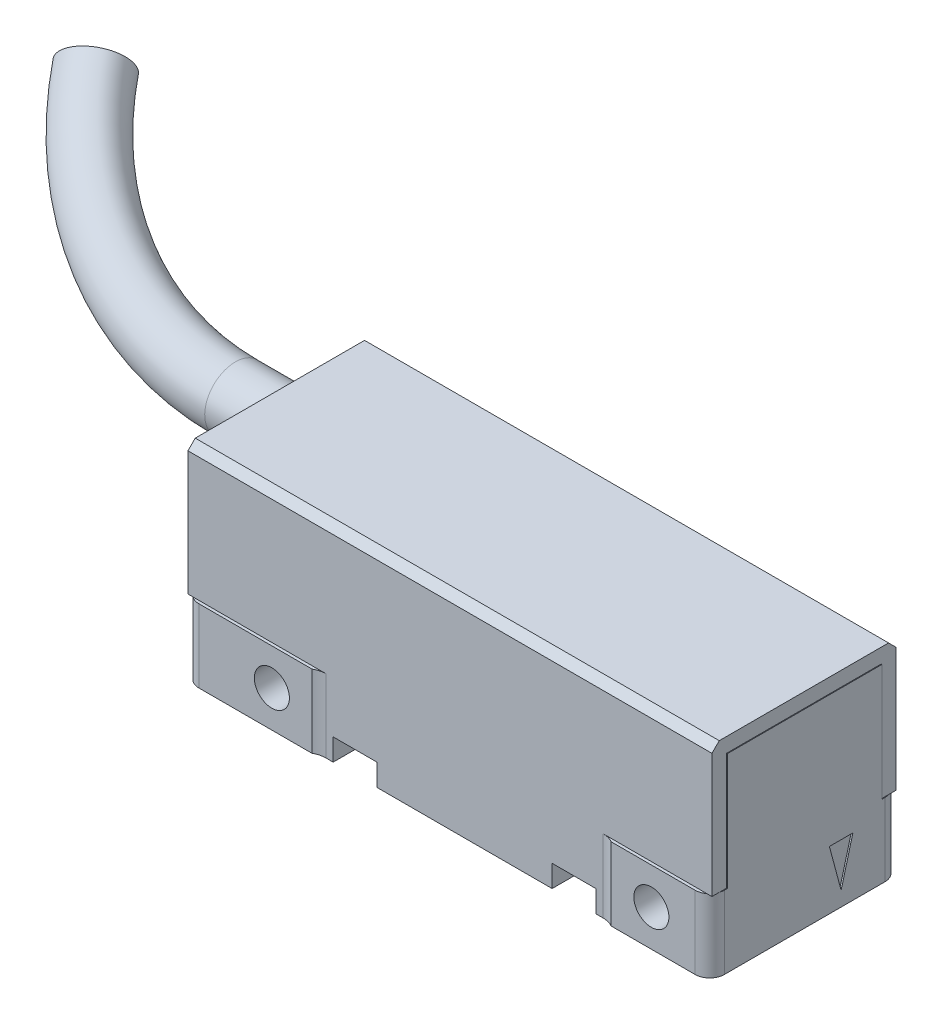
ISO-10303-21;
HEADER;
FILE_DESCRIPTION(('STEP AP214'),'2;1');
FILE_NAME('part.step','',(''),(''),'','','');
FILE_SCHEMA(('AUTOMOTIVE_DESIGN { 1 0 10303 214 1 1 1 1 }'));
ENDSEC;
DATA;
#1=APPLICATION_CONTEXT('core data for automotive mechanical design processes');
#2=APPLICATION_PROTOCOL_DEFINITION('international standard','automotive_design',2000,#1);
#3=PRODUCT_CONTEXT('',#1,'mechanical');
#4=PRODUCT('Part','Part','',(#3));
#5=PRODUCT_RELATED_PRODUCT_CATEGORY('part','',(#4));
#6=PRODUCT_DEFINITION_FORMATION('','',#4);
#7=PRODUCT_DEFINITION_CONTEXT('part definition',#1,'design');
#8=PRODUCT_DEFINITION('design','',#6,#7);
#9=PRODUCT_DEFINITION_SHAPE('','',#8);
#10=(LENGTH_UNIT() NAMED_UNIT(*) SI_UNIT(.MILLI.,.METRE.));
#11=(NAMED_UNIT(*) PLANE_ANGLE_UNIT() SI_UNIT($,.RADIAN.));
#12=(NAMED_UNIT(*) SI_UNIT($,.STERADIAN.) SOLID_ANGLE_UNIT());
#13=UNCERTAINTY_MEASURE_WITH_UNIT(LENGTH_MEASURE(1.E-05),#10,'distance_accuracy_value','');
#14=(GEOMETRIC_REPRESENTATION_CONTEXT(3) GLOBAL_UNCERTAINTY_ASSIGNED_CONTEXT((#13)) GLOBAL_UNIT_ASSIGNED_CONTEXT((#10,
#11,#12)) REPRESENTATION_CONTEXT('',''));
#15=CARTESIAN_POINT('',(0.,0.,0.));
#16=DIRECTION('',(0.,0.,1.));
#17=DIRECTION('',(1.,0.,0.));
#18=AXIS2_PLACEMENT_3D('',#15,#16,#17);
#19=CARTESIAN_POINT('',(0.,0.,13.));
#20=DIRECTION('',(1.,0.,0.));
#21=DIRECTION('',(0.,1.,0.));
#22=AXIS2_PLACEMENT_3D('',#19,#20,#21);
#23=PLANE('',#22);
#24=DIRECTION('',(0.,-0.965925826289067,0.258819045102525));
#25=VECTOR('',#24,1.);
#26=CARTESIAN_POINT('',(0.,4.,3.19615242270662));
#27=LINE('',#26,#25);
#28=CARTESIAN_POINT('',(0.,4.,3.19615242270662));
#29=VERTEX_POINT('',#28);
#30=CARTESIAN_POINT('',(0.,1.,4.));
#31=VERTEX_POINT('',#30);
#32=EDGE_CURVE('E653',#29,#31,#27,.T.);
#33=ORIENTED_EDGE('',*,*,#32,.F.);
#34=DIRECTION('',(0.,0.,-1.));
#35=VECTOR('',#34,1.);
#36=CARTESIAN_POINT('',(0.,4.,4.80384757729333));
#37=LINE('',#36,#35);
#38=CARTESIAN_POINT('',(0.,4.,4.80384757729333));
#39=VERTEX_POINT('',#38);
#40=EDGE_CURVE('E630',#39,#29,#37,.T.);
#41=ORIENTED_EDGE('',*,*,#40,.F.);
#42=DIRECTION('',(0.,0.965925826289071,0.258819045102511));
#43=VECTOR('',#42,1.);
#44=CARTESIAN_POINT('',(0.,1.,4.));
#45=LINE('',#44,#43);
#46=EDGE_CURVE('E642',#31,#39,#45,.T.);
#47=ORIENTED_EDGE('',*,*,#46,.F.);
#48=EDGE_LOOP('',(#33,#41,#47));
#49=FACE_BOUND('',#48,.T.);
#50=DIRECTION('',(0.,1.,0.));
#51=VECTOR('',#50,1.);
#52=CARTESIAN_POINT('',(0.,13.,1.2));
#53=LINE('',#52,#51);
#54=CARTESIAN_POINT('',(0.,5.,1.2));
#55=VERTEX_POINT('',#54);
#56=CARTESIAN_POINT('',(0.,13.,1.2));
#57=VERTEX_POINT('',#56);
#58=EDGE_CURVE('E486',#55,#57,#53,.T.);
#59=ORIENTED_EDGE('',*,*,#58,.F.);
#60=DIRECTION('',(0.,0.,1.));
#61=VECTOR('',#60,1.);
#62=CARTESIAN_POINT('',(0.,5.,1.2));
#63=LINE('',#62,#61);
#64=CARTESIAN_POINT('',(0.,5.,1.00000000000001));
#65=VERTEX_POINT('',#64);
#66=EDGE_CURVE('E483',#65,#55,#63,.T.);
#67=ORIENTED_EDGE('',*,*,#66,.F.);
#68=DIRECTION('',(0.,-1.,0.));
#69=VECTOR('',#68,1.);
#70=CARTESIAN_POINT('',(0.,5.,1.00000000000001));
#71=LINE('',#70,#69);
#72=CARTESIAN_POINT('',(0.,0.,1.00000000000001));
#73=VERTEX_POINT('',#72);
#74=EDGE_CURVE('E565',#65,#73,#71,.T.);
#75=ORIENTED_EDGE('',*,*,#74,.T.);
#76=DIRECTION('',(0.,0.,-1.));
#77=VECTOR('',#76,1.);
#78=CARTESIAN_POINT('',(0.,0.,13.));
#79=LINE('',#78,#77);
#80=CARTESIAN_POINT('',(0.,0.,12.));
#81=VERTEX_POINT('',#80);
#82=EDGE_CURVE('E839',#81,#73,#79,.T.);
#83=ORIENTED_EDGE('',*,*,#82,.F.);
#84=DIRECTION('',(0.,-1.,0.));
#85=VECTOR('',#84,1.);
#86=CARTESIAN_POINT('',(0.,5.,12.));
#87=LINE('',#86,#85);
#88=CARTESIAN_POINT('',(0.,5.,12.));
#89=VERTEX_POINT('',#88);
#90=EDGE_CURVE('E527',#89,#81,#87,.T.);
#91=ORIENTED_EDGE('',*,*,#90,.F.);
#92=DIRECTION('',(0.,0.,1.));
#93=VECTOR('',#92,1.);
#94=CARTESIAN_POINT('',(0.,5.,12.8));
#95=LINE('',#94,#93);
#96=CARTESIAN_POINT('',(0.,5.,11.8));
#97=VERTEX_POINT('',#96);
#98=EDGE_CURVE('E480',#97,#89,#95,.T.);
#99=ORIENTED_EDGE('',*,*,#98,.F.);
#100=DIRECTION('',(0.,-1.,0.));
#101=VECTOR('',#100,1.);
#102=CARTESIAN_POINT('',(0.,5.,11.8));
#103=LINE('',#102,#101);
#104=CARTESIAN_POINT('',(0.,13.,11.8));
#105=VERTEX_POINT('',#104);
#106=EDGE_CURVE('E439',#105,#97,#103,.T.);
#107=ORIENTED_EDGE('',*,*,#106,.F.);
#108=DIRECTION('',(0.,0.,1.));
#109=VECTOR('',#108,1.);
#110=CARTESIAN_POINT('',(0.,13.,1.2));
#111=LINE('',#110,#109);
#112=EDGE_CURVE('E443',#57,#105,#111,.T.);
#113=ORIENTED_EDGE('',*,*,#112,.F.);
#114=EDGE_LOOP('',(#59,#67,#75,#83,#91,#99,#107,#113));
#115=FACE_BOUND('',#114,.T.);
#116=CARTESIAN_POINT('',(0.,8.,9.));
#117=DIRECTION('',(1.,0.,0.));
#118=DIRECTION('',(0.,1.,0.));
#119=AXIS2_PLACEMENT_3D('',#116,#117,#118);
#120=CIRCLE('',#119,1.5);
#121=CARTESIAN_POINT('',(0.,9.5,9.));
#122=VERTEX_POINT('',#121);
#123=EDGE_CURVE('E887',#122,#122,#120,.F.);
#124=ORIENTED_EDGE('',*,*,#123,.F.);
#125=EDGE_LOOP('',(#124));
#126=FACE_BOUND('',#125,.T.);
#127=CARTESIAN_POINT('',(0.,10.,4.5));
#128=DIRECTION('',(1.,0.,0.));
#129=DIRECTION('',(0.,1.,0.));
#130=AXIS2_PLACEMENT_3D('',#127,#128,#129);
#131=CIRCLE('',#130,2.1);
#132=CARTESIAN_POINT('',(0.,12.1,4.5));
#133=VERTEX_POINT('',#132);
#134=EDGE_CURVE('E883',#133,#133,#131,.F.);
#135=ORIENTED_EDGE('',*,*,#134,.F.);
#136=EDGE_LOOP('',(#135));
#137=FACE_BOUND('',#136,.T.);
#138=ADVANCED_FACE('F37',(#49,#115,#126,#137),#23,.F.);
#139=CARTESIAN_POINT('',(36.,0.,13.));
#140=DIRECTION('',(0.,1.,0.));
#141=DIRECTION('',(0.,0.,1.));
#142=AXIS2_PLACEMENT_3D('',#139,#140,#141);
#143=PLANE('',#142);
#144=CARTESIAN_POINT('',(1.,0.,12.));
#145=DIRECTION('',(0.,-1.,0.));
#146=DIRECTION('',(0.,0.,-1.));
#147=AXIS2_PLACEMENT_3D('',#144,#145,#146);
#148=CIRCLE('',#147,1.);
#149=CARTESIAN_POINT('',(1.00000000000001,0.,13.));
#150=VERTEX_POINT('',#149);
#151=EDGE_CURVE('E495',#150,#81,#148,.T.);
#152=ORIENTED_EDGE('',*,*,#151,.T.);
#153=ORIENTED_EDGE('',*,*,#82,.T.);
#154=CARTESIAN_POINT('',(1.,0.,1.));
#155=DIRECTION('',(0.,-1.,0.));
#156=DIRECTION('',(0.,0.,-1.));
#157=AXIS2_PLACEMENT_3D('',#154,#155,#156);
#158=CIRCLE('',#157,1.);
#159=CARTESIAN_POINT('',(1.00000000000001,0.,0.));
#160=VERTEX_POINT('',#159);
#161=EDGE_CURVE('E531',#73,#160,#158,.T.);
#162=ORIENTED_EDGE('',*,*,#161,.T.);
#163=DIRECTION('',(1.,0.,0.));
#164=VECTOR('',#163,1.);
#165=CARTESIAN_POINT('',(36.,0.,0.));
#166=LINE('',#165,#164);
#167=CARTESIAN_POINT('',(8.75166852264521,0.,0.));
#168=VERTEX_POINT('',#167);
#169=EDGE_CURVE('E841',#160,#168,#166,.T.);
#170=ORIENTED_EDGE('',*,*,#169,.T.);
#171=CARTESIAN_POINT('',(9.5,0.,-1.3));
#172=DIRECTION('',(0.,1.,0.));
#173=DIRECTION('',(0.,0.,1.));
#174=AXIS2_PLACEMENT_3D('',#171,#172,#173);
#175=CIRCLE('',#174,1.5);
#176=CARTESIAN_POINT('',(9.5,0.,0.2));
#177=VERTEX_POINT('',#176);
#178=EDGE_CURVE('E795',#168,#177,#175,.T.);
#179=ORIENTED_EDGE('',*,*,#178,.T.);
#180=DIRECTION('',(1.,0.,0.));
#181=VECTOR('',#180,1.);
#182=CARTESIAN_POINT('',(36.,0.,0.200000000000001));
#183=LINE('',#182,#181);
#184=CARTESIAN_POINT('',(10.,0.,0.200000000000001));
#185=VERTEX_POINT('',#184);
#186=EDGE_CURVE('E807',#177,#185,#183,.T.);
#187=ORIENTED_EDGE('',*,*,#186,.T.);
#188=DIRECTION('',(0.,0.,1.));
#189=VECTOR('',#188,1.);
#190=CARTESIAN_POINT('',(10.,0.,13.));
#191=LINE('',#190,#189);
#192=CARTESIAN_POINT('',(10.,0.,12.8));
#193=VERTEX_POINT('',#192);
#194=EDGE_CURVE('E726',#185,#193,#191,.T.);
#195=ORIENTED_EDGE('',*,*,#194,.T.);
#196=DIRECTION('',(-1.,0.,0.));
#197=VECTOR('',#196,1.);
#198=CARTESIAN_POINT('',(36.,0.,12.8));
#199=LINE('',#198,#197);
#200=CARTESIAN_POINT('',(9.5,0.,12.8));
#201=VERTEX_POINT('',#200);
#202=EDGE_CURVE('E776',#193,#201,#199,.T.);
#203=ORIENTED_EDGE('',*,*,#202,.T.);
#204=CARTESIAN_POINT('',(9.5,0.,14.3));
#205=DIRECTION('',(0.,1.,0.));
#206=DIRECTION('',(0.,0.,1.));
#207=AXIS2_PLACEMENT_3D('',#204,#205,#206);
#208=CIRCLE('',#207,1.5);
#209=CARTESIAN_POINT('',(8.75166852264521,0.,13.));
#210=VERTEX_POINT('',#209);
#211=EDGE_CURVE('E781',#201,#210,#208,.T.);
#212=ORIENTED_EDGE('',*,*,#211,.T.);
#213=DIRECTION('',(1.,0.,0.));
#214=VECTOR('',#213,1.);
#215=CARTESIAN_POINT('',(36.,0.,13.));
#216=LINE('',#215,#214);
#217=EDGE_CURVE('E836',#150,#210,#216,.T.);
#218=ORIENTED_EDGE('',*,*,#217,.F.);
#219=EDGE_LOOP('',(#152,#153,#162,#170,#179,#187,#195,#203,#212,#218));
#220=FACE_BOUND('',#219,.T.);
#221=ADVANCED_FACE('F954',(#220),#143,.F.);
#222=CARTESIAN_POINT('',(0.,0.,0.));
#223=DIRECTION('',(0.,0.,-1.));
#224=DIRECTION('',(-1.,0.,0.));
#225=AXIS2_PLACEMENT_3D('',#222,#223,#224);
#226=PLANE('',#225);
#227=CARTESIAN_POINT('',(32.,2.5,0.));
#228=DIRECTION('',(0.,0.,1.));
#229=DIRECTION('',(1.,0.,0.));
#230=AXIS2_PLACEMENT_3D('',#227,#228,#229);
#231=CIRCLE('',#230,1.1999999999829);
#232=CARTESIAN_POINT('',(33.1999999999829,2.5,0.));
#233=VERTEX_POINT('',#232);
#234=EDGE_CURVE('E819',#233,#233,#231,.T.);
#235=ORIENTED_EDGE('',*,*,#234,.T.);
#236=EDGE_LOOP('',(#235));
#237=FACE_BOUND('',#236,.T.);
#238=DIRECTION('',(1.,0.,0.));
#239=VECTOR('',#238,1.);
#240=CARTESIAN_POINT('',(36.,5.,0.));
#241=LINE('',#240,#239);
#242=CARTESIAN_POINT('',(29.2483314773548,5.,0.));
#243=VERTEX_POINT('',#242);
#244=CARTESIAN_POINT('',(35.,5.,0.));
#245=VERTEX_POINT('',#244);
#246=EDGE_CURVE('E734',#243,#245,#241,.T.);
#247=ORIENTED_EDGE('',*,*,#246,.T.);
#248=DIRECTION('',(0.,-1.,0.));
#249=VECTOR('',#248,1.);
#250=CARTESIAN_POINT('',(35.,5.,0.));
#251=LINE('',#250,#249);
#252=CARTESIAN_POINT('',(35.,0.,0.));
#253=VERTEX_POINT('',#252);
#254=EDGE_CURVE('E558',#245,#253,#251,.T.);
#255=ORIENTED_EDGE('',*,*,#254,.T.);
#256=CARTESIAN_POINT('',(29.2483314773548,0.,0.));
#257=VERTEX_POINT('',#256);
#258=EDGE_CURVE('E832',#257,#253,#166,.T.);
#259=ORIENTED_EDGE('',*,*,#258,.F.);
#260=DIRECTION('',(0.,1.,0.));
#261=VECTOR('',#260,1.);
#262=CARTESIAN_POINT('',(29.2483314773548,-7.99999999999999,0.));
#263=LINE('',#262,#261);
#264=EDGE_CURVE('E816',#243,#257,#263,.F.);
#265=ORIENTED_EDGE('',*,*,#264,.F.);
#266=EDGE_LOOP('',(#247,#255,#259,#265));
#267=FACE_BOUND('',#266,.T.);
#268=ADVANCED_FACE('F1006',(#237,#267),#226,.T.);
#269=CARTESIAN_POINT('',(0.,0.,13.));
#270=DIRECTION('',(0.,0.,-1.));
#271=DIRECTION('',(-1.,0.,0.));
#272=AXIS2_PLACEMENT_3D('',#269,#270,#271);
#273=PLANE('',#272);
#274=CARTESIAN_POINT('',(32.,2.5,13.));
#275=DIRECTION('',(0.,0.,1.));
#276=DIRECTION('',(1.,0.,0.));
#277=AXIS2_PLACEMENT_3D('',#274,#275,#276);
#278=CIRCLE('',#277,1.1999999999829);
#279=CARTESIAN_POINT('',(33.1999999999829,2.5,13.));
#280=VERTEX_POINT('',#279);
#281=EDGE_CURVE('E820',#280,#280,#278,.T.);
#282=ORIENTED_EDGE('',*,*,#281,.F.);
#283=EDGE_LOOP('',(#282));
#284=FACE_BOUND('',#283,.T.);
#285=DIRECTION('',(0.,-1.,0.));
#286=VECTOR('',#285,1.);
#287=CARTESIAN_POINT('',(35.,5.,13.));
#288=LINE('',#287,#286);
#289=CARTESIAN_POINT('',(35.,5.,13.));
#290=VERTEX_POINT('',#289);
#291=CARTESIAN_POINT('',(35.,0.,13.));
#292=VERTEX_POINT('',#291);
#293=EDGE_CURVE('E548',#290,#292,#288,.T.);
#294=ORIENTED_EDGE('',*,*,#293,.F.);
#295=DIRECTION('',(-1.,0.,0.));
#296=VECTOR('',#295,1.);
#297=CARTESIAN_POINT('',(0.,5.,13.));
#298=LINE('',#297,#296);
#299=CARTESIAN_POINT('',(29.2483314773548,5.,13.));
#300=VERTEX_POINT('',#299);
#301=EDGE_CURVE('E755',#290,#300,#298,.T.);
#302=ORIENTED_EDGE('',*,*,#301,.T.);
#303=DIRECTION('',(0.,1.,0.));
#304=VECTOR('',#303,1.);
#305=CARTESIAN_POINT('',(29.2483314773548,-7.99999999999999,13.));
#306=LINE('',#305,#304);
#307=CARTESIAN_POINT('',(29.2483314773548,0.,13.));
#308=VERTEX_POINT('',#307);
#309=EDGE_CURVE('E773',#300,#308,#306,.F.);
#310=ORIENTED_EDGE('',*,*,#309,.T.);
#311=EDGE_CURVE('E840',#308,#292,#216,.T.);
#312=ORIENTED_EDGE('',*,*,#311,.T.);
#313=EDGE_LOOP('',(#294,#302,#310,#312));
#314=FACE_BOUND('',#313,.T.);
#315=ADVANCED_FACE('F1227',(#284,#314),#273,.F.);
#316=CARTESIAN_POINT('',(35.,0.,12.));
#317=DIRECTION('',(0.,-1.,0.));
#318=DIRECTION('',(0.,0.,-1.));
#319=AXIS2_PLACEMENT_3D('',#316,#317,#318);
#320=CIRCLE('',#319,1.);
#321=CARTESIAN_POINT('',(36.,0.,12.));
#322=VERTEX_POINT('',#321);
#323=EDGE_CURVE('E539',#322,#292,#320,.T.);
#324=ORIENTED_EDGE('',*,*,#323,.T.);
#325=ORIENTED_EDGE('',*,*,#311,.F.);
#326=CARTESIAN_POINT('',(28.5,0.,14.3));
#327=DIRECTION('',(0.,1.,0.));
#328=DIRECTION('',(0.,0.,1.));
#329=AXIS2_PLACEMENT_3D('',#326,#327,#328);
#330=CIRCLE('',#329,1.5);
#331=CARTESIAN_POINT('',(28.5,0.,12.8));
#332=VERTEX_POINT('',#331);
#333=EDGE_CURVE('E766',#308,#332,#330,.T.);
#334=ORIENTED_EDGE('',*,*,#333,.T.);
#335=CARTESIAN_POINT('',(28.,0.,12.8));
#336=VERTEX_POINT('',#335);
#337=EDGE_CURVE('E777',#332,#336,#199,.T.);
#338=ORIENTED_EDGE('',*,*,#337,.T.);
#339=DIRECTION('',(0.,0.,-1.));
#340=VECTOR('',#339,1.);
#341=CARTESIAN_POINT('',(28.,0.,13.));
#342=LINE('',#341,#340);
#343=CARTESIAN_POINT('',(28.,0.,0.200000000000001));
#344=VERTEX_POINT('',#343);
#345=EDGE_CURVE('E683',#336,#344,#342,.T.);
#346=ORIENTED_EDGE('',*,*,#345,.T.);
#347=CARTESIAN_POINT('',(28.5,0.,0.200000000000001));
#348=VERTEX_POINT('',#347);
#349=EDGE_CURVE('E806',#344,#348,#183,.T.);
#350=ORIENTED_EDGE('',*,*,#349,.T.);
#351=CARTESIAN_POINT('',(28.5,0.,-1.3));
#352=DIRECTION('',(0.,1.,0.));
#353=DIRECTION('',(0.,0.,1.));
#354=AXIS2_PLACEMENT_3D('',#351,#352,#353);
#355=CIRCLE('',#354,1.5);
#356=EDGE_CURVE('E811',#348,#257,#355,.T.);
#357=ORIENTED_EDGE('',*,*,#356,.T.);
#358=ORIENTED_EDGE('',*,*,#258,.T.);
#359=CARTESIAN_POINT('',(35.,0.,1.));
#360=DIRECTION('',(0.,-1.,0.));
#361=DIRECTION('',(0.,0.,-1.));
#362=AXIS2_PLACEMENT_3D('',#359,#360,#361);
#363=CIRCLE('',#362,1.);
#364=CARTESIAN_POINT('',(36.,0.,1.00000000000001));
#365=VERTEX_POINT('',#364);
#366=EDGE_CURVE('E535',#253,#365,#363,.T.);
#367=ORIENTED_EDGE('',*,*,#366,.T.);
#368=DIRECTION('',(0.,0.,-1.));
#369=VECTOR('',#368,1.);
#370=CARTESIAN_POINT('',(36.,0.,13.));
#371=LINE('',#370,#369);
#372=EDGE_CURVE('E847',#322,#365,#371,.T.);
#373=ORIENTED_EDGE('',*,*,#372,.F.);
#374=EDGE_LOOP('',(#324,#325,#334,#338,#346,#350,#357,#358,#367,#373));
#375=FACE_BOUND('',#374,.T.);
#376=ADVANCED_FACE('F979',(#375),#143,.F.);
#377=CARTESIAN_POINT('',(0.,5.,12.8));
#378=DIRECTION('',(0.,1.,0.));
#379=DIRECTION('',(-1.,0.,0.));
#380=AXIS2_PLACEMENT_3D('',#377,#378,#379);
#381=PLANE('',#380);
#382=ORIENTED_EDGE('',*,*,#301,.F.);
#383=CARTESIAN_POINT('',(35.,5.,12.));
#384=DIRECTION('',(0.,1.,0.));
#385=DIRECTION('',(-1.,0.,0.));
#386=AXIS2_PLACEMENT_3D('',#383,#384,#385);
#387=CIRCLE('',#386,1.);
#388=CARTESIAN_POINT('',(35.6,5.,12.8));
#389=VERTEX_POINT('',#388);
#390=EDGE_CURVE('E46',#290,#389,#387,.T.);
#391=ORIENTED_EDGE('',*,*,#390,.T.);
#392=DIRECTION('',(-1.,0.,0.));
#393=VECTOR('',#392,1.);
#394=CARTESIAN_POINT('',(0.,5.,12.8));
#395=LINE('',#394,#393);
#396=CARTESIAN_POINT('',(28.5,5.,12.8));
#397=VERTEX_POINT('',#396);
#398=EDGE_CURVE('E753',#389,#397,#395,.T.);
#399=ORIENTED_EDGE('',*,*,#398,.T.);
#400=CARTESIAN_POINT('',(28.5,5.,14.3));
#401=DIRECTION('',(0.,1.,0.));
#402=DIRECTION('',(-1.,0.,0.));
#403=AXIS2_PLACEMENT_3D('',#400,#401,#402);
#404=CIRCLE('',#403,1.5);
#405=EDGE_CURVE('E851',#397,#300,#404,.F.);
#406=ORIENTED_EDGE('',*,*,#405,.T.);
#407=EDGE_LOOP('',(#382,#391,#399,#406));
#408=FACE_BOUND('',#407,.T.);
#409=ADVANCED_FACE('F918',(#408),#381,.T.);
#410=CARTESIAN_POINT('',(9.5,5.,12.8));
#411=VERTEX_POINT('',#410);
#412=CARTESIAN_POINT('',(0.4,5.,12.8));
#413=VERTEX_POINT('',#412);
#414=EDGE_CURVE('E754',#411,#413,#395,.T.);
#415=ORIENTED_EDGE('',*,*,#414,.T.);
#416=CARTESIAN_POINT('',(1.,5.,12.));
#417=DIRECTION('',(0.,-1.,0.));
#418=DIRECTION('',(0.,0.,-1.));
#419=AXIS2_PLACEMENT_3D('',#416,#417,#418);
#420=CIRCLE('',#419,1.);
#421=CARTESIAN_POINT('',(1.00000000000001,5.,13.));
#422=VERTEX_POINT('',#421);
#423=EDGE_CURVE('E505',#422,#413,#420,.T.);
#424=ORIENTED_EDGE('',*,*,#423,.F.);
#425=CARTESIAN_POINT('',(8.75166852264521,5.,13.));
#426=VERTEX_POINT('',#425);
#427=EDGE_CURVE('E748',#426,#422,#298,.T.);
#428=ORIENTED_EDGE('',*,*,#427,.F.);
#429=CARTESIAN_POINT('',(9.5,5.,14.3));
#430=DIRECTION('',(0.,1.,0.));
#431=DIRECTION('',(-1.,0.,0.));
#432=AXIS2_PLACEMENT_3D('',#429,#430,#431);
#433=CIRCLE('',#432,1.5);
#434=EDGE_CURVE('E752',#426,#411,#433,.F.);
#435=ORIENTED_EDGE('',*,*,#434,.T.);
#436=EDGE_LOOP('',(#415,#424,#428,#435));
#437=FACE_BOUND('',#436,.T.);
#438=ADVANCED_FACE('F943',(#437),#381,.T.);
#439=CARTESIAN_POINT('',(36.,5.,0.2));
#440=DIRECTION('',(0.,1.,0.));
#441=DIRECTION('',(-1.,0.,0.));
#442=AXIS2_PLACEMENT_3D('',#439,#440,#441);
#443=PLANE('',#442);
#444=CARTESIAN_POINT('',(1.00000000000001,5.,0.));
#445=VERTEX_POINT('',#444);
#446=CARTESIAN_POINT('',(8.75166852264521,5.,0.));
#447=VERTEX_POINT('',#446);
#448=EDGE_CURVE('E742',#445,#447,#241,.T.);
#449=ORIENTED_EDGE('',*,*,#448,.F.);
#450=CARTESIAN_POINT('',(1.,5.,1.));
#451=DIRECTION('',(0.,1.,0.));
#452=DIRECTION('',(-1.,0.,0.));
#453=AXIS2_PLACEMENT_3D('',#450,#451,#452);
#454=CIRCLE('',#453,1.);
#455=CARTESIAN_POINT('',(0.4,5.,0.2));
#456=VERTEX_POINT('',#455);
#457=EDGE_CURVE('E908',#445,#456,#454,.T.);
#458=ORIENTED_EDGE('',*,*,#457,.T.);
#459=DIRECTION('',(1.,0.,0.));
#460=VECTOR('',#459,1.);
#461=CARTESIAN_POINT('',(0.,5.,0.2));
#462=LINE('',#461,#460);
#463=CARTESIAN_POINT('',(9.5,5.,0.2));
#464=VERTEX_POINT('',#463);
#465=EDGE_CURVE('E740',#456,#464,#462,.T.);
#466=ORIENTED_EDGE('',*,*,#465,.T.);
#467=CARTESIAN_POINT('',(9.5,5.,-1.3));
#468=DIRECTION('',(0.,1.,0.));
#469=DIRECTION('',(-1.,0.,0.));
#470=AXIS2_PLACEMENT_3D('',#467,#468,#469);
#471=CIRCLE('',#470,1.5);
#472=EDGE_CURVE('E855',#464,#447,#471,.F.);
#473=ORIENTED_EDGE('',*,*,#472,.T.);
#474=EDGE_LOOP('',(#449,#458,#466,#473));
#475=FACE_BOUND('',#474,.T.);
#476=ADVANCED_FACE('F1038',(#475),#443,.T.);
#477=CARTESIAN_POINT('',(28.5,5.,0.2));
#478=VERTEX_POINT('',#477);
#479=CARTESIAN_POINT('',(35.6,5.,0.200000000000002));
#480=VERTEX_POINT('',#479);
#481=EDGE_CURVE('E741',#478,#480,#462,.T.);
#482=ORIENTED_EDGE('',*,*,#481,.T.);
#483=CARTESIAN_POINT('',(35.,5.,1.));
#484=DIRECTION('',(0.,-1.,0.));
#485=DIRECTION('',(0.,0.,-1.));
#486=AXIS2_PLACEMENT_3D('',#483,#484,#485);
#487=CIRCLE('',#486,1.);
#488=EDGE_CURVE('E517',#245,#480,#487,.T.);
#489=ORIENTED_EDGE('',*,*,#488,.F.);
#490=ORIENTED_EDGE('',*,*,#246,.F.);
#491=CARTESIAN_POINT('',(28.5,5.,-1.3));
#492=DIRECTION('',(0.,1.,0.));
#493=DIRECTION('',(-1.,0.,0.));
#494=AXIS2_PLACEMENT_3D('',#491,#492,#493);
#495=CIRCLE('',#494,1.5);
#496=EDGE_CURVE('E739',#243,#478,#495,.F.);
#497=ORIENTED_EDGE('',*,*,#496,.T.);
#498=EDGE_LOOP('',(#482,#489,#490,#497));
#499=FACE_BOUND('',#498,.T.);
#500=ADVANCED_FACE('F1004',(#499),#443,.T.);
#501=CARTESIAN_POINT('',(25.,0.,12.8));
#502=VERTEX_POINT('',#501);
#503=CARTESIAN_POINT('',(13.,0.,12.8));
#504=VERTEX_POINT('',#503);
#505=EDGE_CURVE('E782',#502,#504,#199,.T.);
#506=ORIENTED_EDGE('',*,*,#505,.T.);
#507=DIRECTION('',(0.,0.,-1.));
#508=VECTOR('',#507,1.);
#509=CARTESIAN_POINT('',(13.,0.,13.));
#510=LINE('',#509,#508);
#511=CARTESIAN_POINT('',(13.,0.,0.200000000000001));
#512=VERTEX_POINT('',#511);
#513=EDGE_CURVE('E714',#504,#512,#510,.T.);
#514=ORIENTED_EDGE('',*,*,#513,.T.);
#515=CARTESIAN_POINT('',(25.,0.,0.200000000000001));
#516=VERTEX_POINT('',#515);
#517=EDGE_CURVE('E812',#512,#516,#183,.T.);
#518=ORIENTED_EDGE('',*,*,#517,.T.);
#519=DIRECTION('',(0.,0.,1.));
#520=VECTOR('',#519,1.);
#521=CARTESIAN_POINT('',(25.,0.,13.));
#522=LINE('',#521,#520);
#523=EDGE_CURVE('E706',#516,#502,#522,.T.);
#524=ORIENTED_EDGE('',*,*,#523,.T.);
#525=EDGE_LOOP('',(#506,#514,#518,#524));
#526=FACE_BOUND('',#525,.T.);
#527=ADVANCED_FACE('F962',(#526),#143,.F.);
#528=CARTESIAN_POINT('',(0.,14.,13.));
#529=DIRECTION('',(0.,-1.,0.));
#530=DIRECTION('',(1.,0.,0.));
#531=AXIS2_PLACEMENT_3D('',#528,#529,#530);
#532=PLANE('',#531);
#533=DIRECTION('',(1.,0.,0.));
#534=VECTOR('',#533,1.);
#535=CARTESIAN_POINT('',(0.,14.,12.3));
#536=LINE('',#535,#534);
#537=CARTESIAN_POINT('',(0.0499999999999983,14.,12.3));
#538=VERTEX_POINT('',#537);
#539=CARTESIAN_POINT('',(35.95,14.,12.3));
#540=VERTEX_POINT('',#539);
#541=EDGE_CURVE('E898',#538,#540,#536,.T.);
#542=ORIENTED_EDGE('',*,*,#541,.T.);
#543=DIRECTION('',(0.,0.,-1.));
#544=VECTOR('',#543,1.);
#545=CARTESIAN_POINT('',(35.95,14.,13.));
#546=LINE('',#545,#544);
#547=CARTESIAN_POINT('',(35.95,14.,0.700000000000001));
#548=VERTEX_POINT('',#547);
#549=EDGE_CURVE('E428',#540,#548,#546,.T.);
#550=ORIENTED_EDGE('',*,*,#549,.T.);
#551=DIRECTION('',(-1.,0.,0.));
#552=VECTOR('',#551,1.);
#553=CARTESIAN_POINT('',(0.,14.,0.700000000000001));
#554=LINE('',#553,#552);
#555=CARTESIAN_POINT('',(0.0499999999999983,14.,0.699999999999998));
#556=VERTEX_POINT('',#555);
#557=EDGE_CURVE('E902',#548,#556,#554,.T.);
#558=ORIENTED_EDGE('',*,*,#557,.T.);
#559=DIRECTION('',(0.,0.,-1.));
#560=VECTOR('',#559,1.);
#561=CARTESIAN_POINT('',(0.0499999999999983,14.,0.699999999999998));
#562=LINE('',#561,#560);
#563=EDGE_CURVE('E453',#538,#556,#562,.T.);
#564=ORIENTED_EDGE('',*,*,#563,.F.);
#565=EDGE_LOOP('',(#542,#550,#558,#564));
#566=FACE_BOUND('',#565,.T.);
#567=ADVANCED_FACE('F1055',(#566),#532,.F.);
#568=DIRECTION('',(0.,-1.,0.));
#569=VECTOR('',#568,1.);
#570=CARTESIAN_POINT('',(1.00000000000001,5.,0.));
#571=LINE('',#570,#569);
#572=EDGE_CURVE('E562',#445,#160,#571,.T.);
#573=ORIENTED_EDGE('',*,*,#572,.F.);
#574=ORIENTED_EDGE('',*,*,#448,.T.);
#575=DIRECTION('',(0.,1.,0.));
#576=VECTOR('',#575,1.);
#577=CARTESIAN_POINT('',(8.75166852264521,-8.,0.));
#578=LINE('',#577,#576);
#579=EDGE_CURVE('E802',#168,#447,#578,.T.);
#580=ORIENTED_EDGE('',*,*,#579,.F.);
#581=ORIENTED_EDGE('',*,*,#169,.F.);
#582=EDGE_LOOP('',(#573,#574,#580,#581));
#583=FACE_BOUND('',#582,.T.);
#584=CARTESIAN_POINT('',(6.,2.5,0.));
#585=DIRECTION('',(0.,0.,1.));
#586=DIRECTION('',(1.,0.,0.));
#587=AXIS2_PLACEMENT_3D('',#584,#585,#586);
#588=CIRCLE('',#587,1.2);
#589=CARTESIAN_POINT('',(7.2,2.5,0.));
#590=VERTEX_POINT('',#589);
#591=EDGE_CURVE('E824',#590,#590,#588,.T.);
#592=ORIENTED_EDGE('',*,*,#591,.T.);
#593=EDGE_LOOP('',(#592));
#594=FACE_BOUND('',#593,.T.);
#595=ADVANCED_FACE('F1027',(#583,#594),#226,.T.);
#596=CARTESIAN_POINT('',(28.5,-7.99999999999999,-1.3));
#597=DIRECTION('',(0.,1.,0.));
#598=DIRECTION('',(-1.,0.,0.));
#599=AXIS2_PLACEMENT_3D('',#596,#597,#598);
#600=CYLINDRICAL_SURFACE('',#599,1.5);
#601=ORIENTED_EDGE('',*,*,#496,.F.);
#602=ORIENTED_EDGE('',*,*,#264,.T.);
#603=ORIENTED_EDGE('',*,*,#356,.F.);
#604=DIRECTION('',(0.,1.,0.));
#605=VECTOR('',#604,1.);
#606=CARTESIAN_POINT('',(28.5,-7.99999999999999,0.200000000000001));
#607=LINE('',#606,#605);
#608=EDGE_CURVE('E791',#348,#478,#607,.T.);
#609=ORIENTED_EDGE('',*,*,#608,.T.);
#610=EDGE_LOOP('',(#601,#602,#603,#609));
#611=FACE_BOUND('',#610,.T.);
#612=ADVANCED_FACE('F985',(#611),#600,.F.);
#613=CARTESIAN_POINT('',(9.50000000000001,-8.,-1.3));
#614=DIRECTION('',(0.,1.,0.));
#615=DIRECTION('',(-1.,0.,0.));
#616=AXIS2_PLACEMENT_3D('',#613,#614,#615);
#617=CYLINDRICAL_SURFACE('',#616,1.5);
#618=ORIENTED_EDGE('',*,*,#472,.F.);
#619=DIRECTION('',(0.,1.,0.));
#620=VECTOR('',#619,1.);
#621=CARTESIAN_POINT('',(9.50000000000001,-8.,0.2));
#622=LINE('',#621,#620);
#623=EDGE_CURVE('E790',#177,#464,#622,.T.);
#624=ORIENTED_EDGE('',*,*,#623,.F.);
#625=ORIENTED_EDGE('',*,*,#178,.F.);
#626=ORIENTED_EDGE('',*,*,#579,.T.);
#627=EDGE_LOOP('',(#618,#624,#625,#626));
#628=FACE_BOUND('',#627,.T.);
#629=ADVANCED_FACE('F1032',(#628),#617,.F.);
#630=CARTESIAN_POINT('',(6.,2.5,13.));
#631=DIRECTION('',(0.,0.,1.));
#632=DIRECTION('',(1.,0.,0.));
#633=AXIS2_PLACEMENT_3D('',#630,#631,#632);
#634=CIRCLE('',#633,1.2);
#635=CARTESIAN_POINT('',(7.2,2.5,13.));
#636=VERTEX_POINT('',#635);
#637=EDGE_CURVE('E828',#636,#636,#634,.T.);
#638=ORIENTED_EDGE('',*,*,#637,.F.);
#639=EDGE_LOOP('',(#638));
#640=FACE_BOUND('',#639,.T.);
#641=ORIENTED_EDGE('',*,*,#427,.T.);
#642=DIRECTION('',(0.,-1.,0.));
#643=VECTOR('',#642,1.);
#644=CARTESIAN_POINT('',(1.00000000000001,5.,13.));
#645=LINE('',#644,#643);
#646=EDGE_CURVE('E543',#422,#150,#645,.T.);
#647=ORIENTED_EDGE('',*,*,#646,.T.);
#648=ORIENTED_EDGE('',*,*,#217,.T.);
#649=DIRECTION('',(0.,1.,0.));
#650=VECTOR('',#649,1.);
#651=CARTESIAN_POINT('',(8.75166852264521,-8.,13.));
#652=LINE('',#651,#650);
#653=EDGE_CURVE('E786',#210,#426,#652,.T.);
#654=ORIENTED_EDGE('',*,*,#653,.T.);
#655=EDGE_LOOP('',(#641,#647,#648,#654));
#656=FACE_BOUND('',#655,.T.);
#657=ADVANCED_FACE('F951',(#640,#656),#273,.F.);
#658=CARTESIAN_POINT('',(36.,14.,13.));
#659=DIRECTION('',(-1.,0.,0.));
#660=DIRECTION('',(0.,0.,1.));
#661=AXIS2_PLACEMENT_3D('',#658,#659,#660);
#662=PLANE('',#661);
#663=DIRECTION('',(0.,-0.965925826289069,-0.258819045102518));
#664=VECTOR('',#663,1.);
#665=CARTESIAN_POINT('',(36.,4.,4.80384757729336));
#666=LINE('',#665,#664);
#667=CARTESIAN_POINT('',(36.,4.,4.80384757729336));
#668=VERTEX_POINT('',#667);
#669=CARTESIAN_POINT('',(36.,1.,4.));
#670=VERTEX_POINT('',#669);
#671=EDGE_CURVE('E620',#668,#670,#666,.T.);
#672=ORIENTED_EDGE('',*,*,#671,.F.);
#673=DIRECTION('',(0.,0.,1.));
#674=VECTOR('',#673,1.);
#675=CARTESIAN_POINT('',(36.,4.,3.19615242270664));
#676=LINE('',#675,#674);
#677=CARTESIAN_POINT('',(36.,4.,3.19615242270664));
#678=VERTEX_POINT('',#677);
#679=EDGE_CURVE('E597',#678,#668,#676,.T.);
#680=ORIENTED_EDGE('',*,*,#679,.F.);
#681=DIRECTION('',(0.,0.965925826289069,-0.258819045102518));
#682=VECTOR('',#681,1.);
#683=CARTESIAN_POINT('',(36.,1.,4.));
#684=LINE('',#683,#682);
#685=EDGE_CURVE('E609',#670,#678,#684,.T.);
#686=ORIENTED_EDGE('',*,*,#685,.F.);
#687=EDGE_LOOP('',(#672,#680,#686));
#688=FACE_BOUND('',#687,.T.);
#689=DIRECTION('',(0.,1.,0.));
#690=VECTOR('',#689,1.);
#691=CARTESIAN_POINT('',(36.,13.,11.8));
#692=LINE('',#691,#690);
#693=CARTESIAN_POINT('',(36.,5.,11.8));
#694=VERTEX_POINT('',#693);
#695=CARTESIAN_POINT('',(36.,13.,11.8));
#696=VERTEX_POINT('',#695);
#697=EDGE_CURVE('E387',#694,#696,#692,.T.);
#698=ORIENTED_EDGE('',*,*,#697,.F.);
#699=DIRECTION('',(0.,0.,-1.));
#700=VECTOR('',#699,1.);
#701=CARTESIAN_POINT('',(36.,5.,12.8));
#702=LINE('',#701,#700);
#703=CARTESIAN_POINT('',(36.,5.,12.));
#704=VERTEX_POINT('',#703);
#705=EDGE_CURVE('E393',#704,#694,#702,.T.);
#706=ORIENTED_EDGE('',*,*,#705,.F.);
#707=DIRECTION('',(0.,-1.,0.));
#708=VECTOR('',#707,1.);
#709=CARTESIAN_POINT('',(36.,5.,12.));
#710=LINE('',#709,#708);
#711=EDGE_CURVE('E551',#704,#322,#710,.T.);
#712=ORIENTED_EDGE('',*,*,#711,.T.);
#713=ORIENTED_EDGE('',*,*,#372,.T.);
#714=DIRECTION('',(0.,-1.,0.));
#715=VECTOR('',#714,1.);
#716=CARTESIAN_POINT('',(36.,5.,1.00000000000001));
#717=LINE('',#716,#715);
#718=CARTESIAN_POINT('',(36.,5.,1.00000000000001));
#719=VERTEX_POINT('',#718);
#720=EDGE_CURVE('E555',#719,#365,#717,.T.);
#721=ORIENTED_EDGE('',*,*,#720,.F.);
#722=DIRECTION('',(0.,0.,-1.));
#723=VECTOR('',#722,1.);
#724=CARTESIAN_POINT('',(36.,5.,1.2));
#725=LINE('',#724,#723);
#726=CARTESIAN_POINT('',(36.,5.,1.2));
#727=VERTEX_POINT('',#726);
#728=EDGE_CURVE('E411',#727,#719,#725,.T.);
#729=ORIENTED_EDGE('',*,*,#728,.F.);
#730=DIRECTION('',(0.,-1.,0.));
#731=VECTOR('',#730,1.);
#732=CARTESIAN_POINT('',(36.,13.,1.2));
#733=LINE('',#732,#731);
#734=CARTESIAN_POINT('',(36.,13.,1.2));
#735=VERTEX_POINT('',#734);
#736=EDGE_CURVE('E408',#735,#727,#733,.T.);
#737=ORIENTED_EDGE('',*,*,#736,.F.);
#738=DIRECTION('',(0.,0.,-1.));
#739=VECTOR('',#738,1.);
#740=CARTESIAN_POINT('',(36.,13.,11.8));
#741=LINE('',#740,#739);
#742=EDGE_CURVE('E368',#696,#735,#741,.T.);
#743=ORIENTED_EDGE('',*,*,#742,.F.);
#744=EDGE_LOOP('',(#698,#706,#712,#713,#721,#729,#737,#743));
#745=FACE_BOUND('',#744,.T.);
#746=ADVANCED_FACE('F1073',(#688,#745),#662,.F.);
#747=CARTESIAN_POINT('',(9.50000000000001,-8.,14.3));
#748=DIRECTION('',(0.,1.,0.));
#749=DIRECTION('',(-1.,0.,0.));
#750=AXIS2_PLACEMENT_3D('',#747,#748,#749);
#751=CYLINDRICAL_SURFACE('',#750,1.5);
#752=ORIENTED_EDGE('',*,*,#434,.F.);
#753=ORIENTED_EDGE('',*,*,#653,.F.);
#754=ORIENTED_EDGE('',*,*,#211,.F.);
#755=DIRECTION('',(0.,1.,0.));
#756=VECTOR('',#755,1.);
#757=CARTESIAN_POINT('',(9.50000000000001,-8.,12.8));
#758=LINE('',#757,#756);
#759=EDGE_CURVE('E762',#201,#411,#758,.T.);
#760=ORIENTED_EDGE('',*,*,#759,.T.);
#761=EDGE_LOOP('',(#752,#753,#754,#760));
#762=FACE_BOUND('',#761,.T.);
#763=ADVANCED_FACE('F948',(#762),#751,.F.);
#764=CARTESIAN_POINT('',(28.5,-7.99999999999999,14.3));
#765=DIRECTION('',(0.,1.,0.));
#766=DIRECTION('',(-1.,0.,0.));
#767=AXIS2_PLACEMENT_3D('',#764,#765,#766);
#768=CYLINDRICAL_SURFACE('',#767,1.5);
#769=ORIENTED_EDGE('',*,*,#405,.F.);
#770=DIRECTION('',(0.,1.,0.));
#771=VECTOR('',#770,1.);
#772=CARTESIAN_POINT('',(28.5,-7.99999999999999,12.8));
#773=LINE('',#772,#771);
#774=EDGE_CURVE('E761',#332,#397,#773,.T.);
#775=ORIENTED_EDGE('',*,*,#774,.F.);
#776=ORIENTED_EDGE('',*,*,#333,.F.);
#777=ORIENTED_EDGE('',*,*,#309,.F.);
#778=EDGE_LOOP('',(#769,#775,#776,#777));
#779=FACE_BOUND('',#778,.T.);
#780=ADVANCED_FACE('F1205',(#779),#768,.F.);
#781=CARTESIAN_POINT('',(6.,2.5,13.));
#782=DIRECTION('',(0.,0.,-1.));
#783=DIRECTION('',(-1.,0.,0.));
#784=AXIS2_PLACEMENT_3D('',#781,#782,#783);
#785=CYLINDRICAL_SURFACE('',#784,1.2);
#786=ORIENTED_EDGE('',*,*,#637,.T.);
#787=EDGE_LOOP('',(#786));
#788=FACE_BOUND('',#787,.T.);
#789=ORIENTED_EDGE('',*,*,#591,.F.);
#790=EDGE_LOOP('',(#789));
#791=FACE_BOUND('',#790,.T.);
#792=ADVANCED_FACE('F1210',(#788,#791),#785,.F.);
#793=CARTESIAN_POINT('',(32.,2.5,13.));
#794=DIRECTION('',(0.,0.,-1.));
#795=DIRECTION('',(-1.,0.,0.));
#796=AXIS2_PLACEMENT_3D('',#793,#794,#795);
#797=CYLINDRICAL_SURFACE('',#796,1.1999999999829);
#798=ORIENTED_EDGE('',*,*,#281,.T.);
#799=EDGE_LOOP('',(#798));
#800=FACE_BOUND('',#799,.T.);
#801=ORIENTED_EDGE('',*,*,#234,.F.);
#802=EDGE_LOOP('',(#801));
#803=FACE_BOUND('',#802,.T.);
#804=ADVANCED_FACE('F1216',(#800,#803),#797,.F.);
#805=CARTESIAN_POINT('',(9.50000000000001,-8.,0.2));
#806=DIRECTION('',(0.,0.,1.));
#807=DIRECTION('',(1.,0.,0.));
#808=AXIS2_PLACEMENT_3D('',#805,#806,#807);
#809=PLANE('',#808);
#810=DIRECTION('',(-0.258819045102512,-0.965925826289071,0.));
#811=VECTOR('',#810,1.);
#812=CARTESIAN_POINT('',(19.8038475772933,4.,0.2));
#813=LINE('',#812,#811);
#814=CARTESIAN_POINT('',(19.8038475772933,4.,0.2));
#815=VERTEX_POINT('',#814);
#816=CARTESIAN_POINT('',(19.,1.,0.2));
#817=VERTEX_POINT('',#816);
#818=EDGE_CURVE('E587',#815,#817,#813,.T.);
#819=ORIENTED_EDGE('',*,*,#818,.F.);
#820=DIRECTION('',(1.,0.,0.));
#821=VECTOR('',#820,1.);
#822=CARTESIAN_POINT('',(18.1961524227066,4.,0.2));
#823=LINE('',#822,#821);
#824=CARTESIAN_POINT('',(18.1961524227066,4.,0.2));
#825=VERTEX_POINT('',#824);
#826=EDGE_CURVE('E547',#825,#815,#823,.T.);
#827=ORIENTED_EDGE('',*,*,#826,.F.);
#828=DIRECTION('',(-0.258819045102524,0.965925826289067,0.));
#829=VECTOR('',#828,1.);
#830=CARTESIAN_POINT('',(19.,1.,0.2));
#831=LINE('',#830,#829);
#832=EDGE_CURVE('E576',#817,#825,#831,.T.);
#833=ORIENTED_EDGE('',*,*,#832,.F.);
#834=EDGE_LOOP('',(#819,#827,#833));
#835=FACE_BOUND('',#834,.T.);
#836=DIRECTION('',(1.,0.,0.));
#837=VECTOR('',#836,1.);
#838=CARTESIAN_POINT('',(9.5,13.5,0.2));
#839=LINE('',#838,#837);
#840=CARTESIAN_POINT('',(0.0499999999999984,13.5,0.2));
#841=VERTEX_POINT('',#840);
#842=CARTESIAN_POINT('',(35.95,13.5,0.2));
#843=VERTEX_POINT('',#842);
#844=EDGE_CURVE('E891',#841,#843,#839,.T.);
#845=ORIENTED_EDGE('',*,*,#844,.T.);
#846=DIRECTION('',(0.,-1.,0.));
#847=VECTOR('',#846,1.);
#848=CARTESIAN_POINT('',(35.95,-8.,0.2));
#849=LINE('',#848,#847);
#850=CARTESIAN_POINT('',(35.95,5.,0.200000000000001));
#851=VERTEX_POINT('',#850);
#852=EDGE_CURVE('E435',#843,#851,#849,.T.);
#853=ORIENTED_EDGE('',*,*,#852,.T.);
#854=EDGE_CURVE('E745',#480,#851,#462,.T.);
#855=ORIENTED_EDGE('',*,*,#854,.F.);
#856=ORIENTED_EDGE('',*,*,#481,.F.);
#857=ORIENTED_EDGE('',*,*,#608,.F.);
#858=ORIENTED_EDGE('',*,*,#349,.F.);
#859=DIRECTION('',(0.,1.,0.));
#860=VECTOR('',#859,1.);
#861=CARTESIAN_POINT('',(28.,-8.,0.2));
#862=LINE('',#861,#860);
#863=CARTESIAN_POINT('',(28.,1.5,0.2));
#864=VERTEX_POINT('',#863);
#865=EDGE_CURVE('E698',#344,#864,#862,.T.);
#866=ORIENTED_EDGE('',*,*,#865,.T.);
#867=DIRECTION('',(-1.,0.,0.));
#868=VECTOR('',#867,1.);
#869=CARTESIAN_POINT('',(9.50000000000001,1.5,0.2));
#870=LINE('',#869,#868);
#871=CARTESIAN_POINT('',(25.,1.5,0.2));
#872=VERTEX_POINT('',#871);
#873=EDGE_CURVE('E702',#864,#872,#870,.T.);
#874=ORIENTED_EDGE('',*,*,#873,.T.);
#875=DIRECTION('',(0.,-1.,0.));
#876=VECTOR('',#875,1.);
#877=CARTESIAN_POINT('',(25.,-8.,0.2));
#878=LINE('',#877,#876);
#879=EDGE_CURVE('E710',#872,#516,#878,.T.);
#880=ORIENTED_EDGE('',*,*,#879,.T.);
#881=ORIENTED_EDGE('',*,*,#517,.F.);
#882=DIRECTION('',(0.,1.,0.));
#883=VECTOR('',#882,1.);
#884=CARTESIAN_POINT('',(13.,-8.,0.2));
#885=LINE('',#884,#883);
#886=CARTESIAN_POINT('',(13.,1.5,0.2));
#887=VERTEX_POINT('',#886);
#888=EDGE_CURVE('E718',#512,#887,#885,.T.);
#889=ORIENTED_EDGE('',*,*,#888,.T.);
#890=DIRECTION('',(-1.,0.,0.));
#891=VECTOR('',#890,1.);
#892=CARTESIAN_POINT('',(9.50000000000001,1.5,0.2));
#893=LINE('',#892,#891);
#894=CARTESIAN_POINT('',(10.,1.5,0.2));
#895=VERTEX_POINT('',#894);
#896=EDGE_CURVE('E722',#887,#895,#893,.T.);
#897=ORIENTED_EDGE('',*,*,#896,.T.);
#898=DIRECTION('',(0.,-1.,0.));
#899=VECTOR('',#898,1.);
#900=CARTESIAN_POINT('',(10.,-8.,0.2));
#901=LINE('',#900,#899);
#902=EDGE_CURVE('E730',#895,#185,#901,.T.);
#903=ORIENTED_EDGE('',*,*,#902,.T.);
#904=ORIENTED_EDGE('',*,*,#186,.F.);
#905=ORIENTED_EDGE('',*,*,#623,.T.);
#906=ORIENTED_EDGE('',*,*,#465,.F.);
#907=CARTESIAN_POINT('',(0.0499999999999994,5.,0.2));
#908=VERTEX_POINT('',#907);
#909=EDGE_CURVE('E735',#908,#456,#462,.T.);
#910=ORIENTED_EDGE('',*,*,#909,.F.);
#911=DIRECTION('',(0.,-1.,0.));
#912=VECTOR('',#911,1.);
#913=CARTESIAN_POINT('',(0.0499999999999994,5.,0.2));
#914=LINE('',#913,#912);
#915=EDGE_CURVE('E460',#841,#908,#914,.T.);
#916=ORIENTED_EDGE('',*,*,#915,.F.);
#917=EDGE_LOOP('',(#845,#853,#855,#856,#857,#858,#866,#874,#880,#881,#889,#897,#903,#904,#905,
#906,#910,#916));
#918=FACE_BOUND('',#917,.T.);
#919=ADVANCED_FACE('F972',(#835,#918),#809,.F.);
#920=CARTESIAN_POINT('',(9.50000000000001,-8.,12.8));
#921=DIRECTION('',(0.,0.,-1.));
#922=DIRECTION('',(-1.,0.,0.));
#923=AXIS2_PLACEMENT_3D('',#920,#921,#922);
#924=PLANE('',#923);
#925=CARTESIAN_POINT('',(35.95,5.,12.8));
#926=VERTEX_POINT('',#925);
#927=EDGE_CURVE('E749',#926,#389,#395,.T.);
#928=ORIENTED_EDGE('',*,*,#927,.F.);
#929=DIRECTION('',(0.,-1.,0.));
#930=VECTOR('',#929,1.);
#931=CARTESIAN_POINT('',(35.95,13.5239763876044,12.8));
#932=LINE('',#931,#930);
#933=CARTESIAN_POINT('',(35.95,13.5,12.8));
#934=VERTEX_POINT('',#933);
#935=EDGE_CURVE('E399',#934,#926,#932,.T.);
#936=ORIENTED_EDGE('',*,*,#935,.F.);
#937=DIRECTION('',(-1.,0.,0.));
#938=VECTOR('',#937,1.);
#939=CARTESIAN_POINT('',(9.5,13.5,12.8));
#940=LINE('',#939,#938);
#941=CARTESIAN_POINT('',(0.0499999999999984,13.5,12.8));
#942=VERTEX_POINT('',#941);
#943=EDGE_CURVE('E905',#934,#942,#940,.T.);
#944=ORIENTED_EDGE('',*,*,#943,.T.);
#945=DIRECTION('',(0.,1.,0.));
#946=VECTOR('',#945,1.);
#947=CARTESIAN_POINT('',(0.0499999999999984,13.5,12.8));
#948=LINE('',#947,#946);
#949=CARTESIAN_POINT('',(0.0499999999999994,5.,12.8));
#950=VERTEX_POINT('',#949);
#951=EDGE_CURVE('E446',#950,#942,#948,.T.);
#952=ORIENTED_EDGE('',*,*,#951,.F.);
#953=EDGE_CURVE('E758',#413,#950,#395,.T.);
#954=ORIENTED_EDGE('',*,*,#953,.F.);
#955=ORIENTED_EDGE('',*,*,#414,.F.);
#956=ORIENTED_EDGE('',*,*,#759,.F.);
#957=ORIENTED_EDGE('',*,*,#202,.F.);
#958=DIRECTION('',(0.,1.,0.));
#959=VECTOR('',#958,1.);
#960=CARTESIAN_POINT('',(10.,-8.,12.8));
#961=LINE('',#960,#959);
#962=CARTESIAN_POINT('',(10.,1.5,12.8));
#963=VERTEX_POINT('',#962);
#964=EDGE_CURVE('E879',#193,#963,#961,.T.);
#965=ORIENTED_EDGE('',*,*,#964,.T.);
#966=DIRECTION('',(1.,0.,0.));
#967=VECTOR('',#966,1.);
#968=CARTESIAN_POINT('',(9.50000000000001,1.5,12.8));
#969=LINE('',#968,#967);
#970=CARTESIAN_POINT('',(13.,1.5,12.8));
#971=VERTEX_POINT('',#970);
#972=EDGE_CURVE('E875',#963,#971,#969,.T.);
#973=ORIENTED_EDGE('',*,*,#972,.T.);
#974=DIRECTION('',(0.,-1.,0.));
#975=VECTOR('',#974,1.);
#976=CARTESIAN_POINT('',(13.,-8.,12.8));
#977=LINE('',#976,#975);
#978=EDGE_CURVE('E871',#971,#504,#977,.T.);
#979=ORIENTED_EDGE('',*,*,#978,.T.);
#980=ORIENTED_EDGE('',*,*,#505,.F.);
#981=DIRECTION('',(0.,1.,0.));
#982=VECTOR('',#981,1.);
#983=CARTESIAN_POINT('',(25.,-8.,12.8));
#984=LINE('',#983,#982);
#985=CARTESIAN_POINT('',(25.,1.5,12.8));
#986=VERTEX_POINT('',#985);
#987=EDGE_CURVE('E867',#502,#986,#984,.T.);
#988=ORIENTED_EDGE('',*,*,#987,.T.);
#989=DIRECTION('',(1.,0.,0.));
#990=VECTOR('',#989,1.);
#991=CARTESIAN_POINT('',(9.50000000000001,1.5,12.8));
#992=LINE('',#991,#990);
#993=CARTESIAN_POINT('',(28.,1.5,12.8));
#994=VERTEX_POINT('',#993);
#995=EDGE_CURVE('E863',#986,#994,#992,.T.);
#996=ORIENTED_EDGE('',*,*,#995,.T.);
#997=DIRECTION('',(0.,-1.,0.));
#998=VECTOR('',#997,1.);
#999=CARTESIAN_POINT('',(28.,-8.,12.8));
#1000=LINE('',#999,#998);
#1001=EDGE_CURVE('E859',#994,#336,#1000,.T.);
#1002=ORIENTED_EDGE('',*,*,#1001,.T.);
#1003=ORIENTED_EDGE('',*,*,#337,.F.);
#1004=ORIENTED_EDGE('',*,*,#774,.T.);
#1005=ORIENTED_EDGE('',*,*,#398,.F.);
#1006=EDGE_LOOP('',(#928,#936,#944,#952,#954,#955,#956,#957,#965,#973,#979,#980,#988,#996,#1002,
#1003,#1004,#1005));
#1007=FACE_BOUND('',#1006,.T.);
#1008=ADVANCED_FACE('F925',(#1007),#924,.F.);
#1009=CARTESIAN_POINT('',(28.,1.5,-2.));
#1010=DIRECTION('',(1.,0.,0.));
#1011=DIRECTION('',(0.,0.,-1.));
#1012=AXIS2_PLACEMENT_3D('',#1009,#1010,#1011);
#1013=PLANE('',#1012);
#1014=ORIENTED_EDGE('',*,*,#345,.F.);
#1015=ORIENTED_EDGE('',*,*,#1001,.F.);
#1016=DIRECTION('',(0.,0.,1.));
#1017=VECTOR('',#1016,1.);
#1018=CARTESIAN_POINT('',(28.,1.5,-2.));
#1019=LINE('',#1018,#1017);
#1020=EDGE_CURVE('E678',#864,#994,#1019,.T.);
#1021=ORIENTED_EDGE('',*,*,#1020,.F.);
#1022=ORIENTED_EDGE('',*,*,#865,.F.);
#1023=EDGE_LOOP('',(#1014,#1015,#1021,#1022));
#1024=FACE_BOUND('',#1023,.T.);
#1025=ADVANCED_FACE('F1191',(#1024),#1013,.F.);
#1026=CARTESIAN_POINT('',(25.,1.5,-2.));
#1027=DIRECTION('',(0.,1.,0.));
#1028=DIRECTION('',(0.,0.,1.));
#1029=AXIS2_PLACEMENT_3D('',#1026,#1027,#1028);
#1030=PLANE('',#1029);
#1031=ORIENTED_EDGE('',*,*,#1020,.T.);
#1032=ORIENTED_EDGE('',*,*,#995,.F.);
#1033=DIRECTION('',(0.,0.,1.));
#1034=VECTOR('',#1033,1.);
#1035=CARTESIAN_POINT('',(25.,1.5,-2.));
#1036=LINE('',#1035,#1034);
#1037=EDGE_CURVE('E688',#872,#986,#1036,.T.);
#1038=ORIENTED_EDGE('',*,*,#1037,.F.);
#1039=ORIENTED_EDGE('',*,*,#873,.F.);
#1040=EDGE_LOOP('',(#1031,#1032,#1038,#1039));
#1041=FACE_BOUND('',#1040,.T.);
#1042=ADVANCED_FACE('F1187',(#1041),#1030,.F.);
#1043=CARTESIAN_POINT('',(25.,1.5,-2.));
#1044=DIRECTION('',(-1.,0.,0.));
#1045=DIRECTION('',(0.,0.,1.));
#1046=AXIS2_PLACEMENT_3D('',#1043,#1044,#1045);
#1047=PLANE('',#1046);
#1048=ORIENTED_EDGE('',*,*,#1037,.T.);
#1049=ORIENTED_EDGE('',*,*,#987,.F.);
#1050=ORIENTED_EDGE('',*,*,#523,.F.);
#1051=ORIENTED_EDGE('',*,*,#879,.F.);
#1052=EDGE_LOOP('',(#1048,#1049,#1050,#1051));
#1053=FACE_BOUND('',#1052,.T.);
#1054=ADVANCED_FACE('F1184',(#1053),#1047,.F.);
#1055=CARTESIAN_POINT('',(10.,1.5,-2.));
#1056=DIRECTION('',(-1.,0.,0.));
#1057=DIRECTION('',(0.,0.,1.));
#1058=AXIS2_PLACEMENT_3D('',#1055,#1056,#1057);
#1059=PLANE('',#1058);
#1060=DIRECTION('',(0.,0.,1.));
#1061=VECTOR('',#1060,1.);
#1062=CARTESIAN_POINT('',(10.,1.5,-2.));
#1063=LINE('',#1062,#1061);
#1064=EDGE_CURVE('E679',#895,#963,#1063,.T.);
#1065=ORIENTED_EDGE('',*,*,#1064,.T.);
#1066=ORIENTED_EDGE('',*,*,#964,.F.);
#1067=ORIENTED_EDGE('',*,*,#194,.F.);
#1068=ORIENTED_EDGE('',*,*,#902,.F.);
#1069=EDGE_LOOP('',(#1065,#1066,#1067,#1068));
#1070=FACE_BOUND('',#1069,.T.);
#1071=ADVANCED_FACE('F1181',(#1070),#1059,.F.);
#1072=CARTESIAN_POINT('',(10.,1.5,-2.));
#1073=DIRECTION('',(0.,1.,0.));
#1074=DIRECTION('',(0.,0.,1.));
#1075=AXIS2_PLACEMENT_3D('',#1072,#1073,#1074);
#1076=PLANE('',#1075);
#1077=DIRECTION('',(0.,0.,1.));
#1078=VECTOR('',#1077,1.);
#1079=CARTESIAN_POINT('',(13.,1.5,-2.));
#1080=LINE('',#1079,#1078);
#1081=EDGE_CURVE('E684',#887,#971,#1080,.T.);
#1082=ORIENTED_EDGE('',*,*,#1081,.T.);
#1083=ORIENTED_EDGE('',*,*,#972,.F.);
#1084=ORIENTED_EDGE('',*,*,#1064,.F.);
#1085=ORIENTED_EDGE('',*,*,#896,.F.);
#1086=EDGE_LOOP('',(#1082,#1083,#1084,#1085));
#1087=FACE_BOUND('',#1086,.T.);
#1088=ADVANCED_FACE('F969',(#1087),#1076,.F.);
#1089=CARTESIAN_POINT('',(13.,1.5,-2.));
#1090=DIRECTION('',(1.,0.,0.));
#1091=DIRECTION('',(0.,0.,-1.));
#1092=AXIS2_PLACEMENT_3D('',#1089,#1090,#1091);
#1093=PLANE('',#1092);
#1094=ORIENTED_EDGE('',*,*,#513,.F.);
#1095=ORIENTED_EDGE('',*,*,#978,.F.);
#1096=ORIENTED_EDGE('',*,*,#1081,.F.);
#1097=ORIENTED_EDGE('',*,*,#888,.F.);
#1098=EDGE_LOOP('',(#1094,#1095,#1096,#1097));
#1099=FACE_BOUND('',#1098,.T.);
#1100=ADVANCED_FACE('F967',(#1099),#1093,.F.);
#1101=CARTESIAN_POINT('',(-5.,10.,4.5));
#1102=DIRECTION('',(1.,0.,0.));
#1103=DIRECTION('',(0.,1.,0.));
#1104=AXIS2_PLACEMENT_3D('',#1101,#1102,#1103);
#1105=CYLINDRICAL_SURFACE('',#1104,2.1);
#1106=CARTESIAN_POINT('',(-5.,10.,4.5));
#1107=DIRECTION('',(-1.,0.,0.));
#1108=DIRECTION('',(0.,-1.,0.));
#1109=AXIS2_PLACEMENT_3D('',#1106,#1107,#1108);
#1110=CIRCLE('',#1109,2.1);
#1111=CARTESIAN_POINT('',(-5.,8.86867037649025,6.26920696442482));
#1112=VERTEX_POINT('',#1111);
#1113=EDGE_CURVE('E674',#1112,#1112,#1110,.T.);
#1114=ORIENTED_EDGE('',*,*,#1113,.F.);
#1115=EDGE_LOOP('',(#1114));
#1116=FACE_BOUND('',#1115,.T.);
#1117=ORIENTED_EDGE('',*,*,#134,.T.);
#1118=EDGE_LOOP('',(#1117));
#1119=FACE_BOUND('',#1118,.T.);
#1120=ADVANCED_FACE('F1174',(#1116,#1119),#1105,.T.);
#1121=CARTESIAN_POINT('',(-0.050000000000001,8.,9.));
#1122=DIRECTION('',(1.,0.,0.));
#1123=DIRECTION('',(0.,1.,0.));
#1124=AXIS2_PLACEMENT_3D('',#1121,#1122,#1123);
#1125=CYLINDRICAL_SURFACE('',#1124,1.5);
#1126=CARTESIAN_POINT('',(-0.050000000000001,8.,9.));
#1127=DIRECTION('',(-1.,0.,0.));
#1128=DIRECTION('',(0.,-1.,0.));
#1129=AXIS2_PLACEMENT_3D('',#1126,#1127,#1128);
#1130=CIRCLE('',#1129,1.5);
#1131=CARTESIAN_POINT('',(-0.0500000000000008,6.5,9.));
#1132=VERTEX_POINT('',#1131);
#1133=EDGE_CURVE('E673',#1132,#1132,#1130,.T.);
#1134=ORIENTED_EDGE('',*,*,#1133,.F.);
#1135=EDGE_LOOP('',(#1134));
#1136=FACE_BOUND('',#1135,.T.);
#1137=ORIENTED_EDGE('',*,*,#123,.T.);
#1138=EDGE_LOOP('',(#1137));
#1139=FACE_BOUND('',#1138,.T.);
#1140=ADVANCED_FACE('F1106',(#1136,#1139),#1125,.T.);
#1141=CARTESIAN_POINT('',(0.0535714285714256,8.,9.));
#1142=DIRECTION('',(0.,0.,1.));
#1143=DIRECTION('',(1.,0.,0.));
#1144=AXIS2_PLACEMENT_3D('',#1141,#1142,#1143);
#1145=SPHERICAL_SURFACE('',#1144,1.50357142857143);
#1146=CARTESIAN_POINT('',(0.0535714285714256,8.,9.));
#1147=DIRECTION('',(-1.,0.,0.));
#1148=DIRECTION('',(0.,-1.,0.));
#1149=AXIS2_PLACEMENT_3D('',#1146,#1147,#1148);
#1150=SPHERICAL_SURFACE('',#1149,1.50357142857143);
#1151=ORIENTED_EDGE('',*,*,#1133,.T.);
#1152=EDGE_LOOP('',(#1151));
#1153=FACE_BOUND('',#1152,.T.);
#1154=ADVANCED_FACE('F1103',(#1153),#1150,.T.);
#1155=CARTESIAN_POINT('',(-5.,21.5856540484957,-13.6179909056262));
#1156=DIRECTION('',(0.,0.842479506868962,0.5387283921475));
#1157=DIRECTION('',(0.,-0.5387283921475,0.842479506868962));
#1158=AXIS2_PLACEMENT_3D('',#1155,#1156,#1157);
#1159=TOROIDAL_SURFACE('',#1158,21.5055568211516,2.1);
#1160=CARTESIAN_POINT('',(-23.624358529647,15.7928270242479,-4.55899545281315));
#1161=DIRECTION('',(-0.499999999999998,0.46655247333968,-0.729608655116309));
#1162=DIRECTION('',(-0.46655247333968,-0.854885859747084,-0.226933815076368));
#1163=AXIS2_PLACEMENT_3D('',#1160,#1161,#1162);
#1164=CIRCLE('',#1163,2.1);
#1165=CARTESIAN_POINT('',(-25.4430118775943,15.227162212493,-3.67439197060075));
#1166=VERTEX_POINT('',#1165);
#1167=EDGE_CURVE('E663',#1166,#1166,#1164,.T.);
#1168=CARTESIAN_POINT('',(-5.,21.5856540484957,-13.6179909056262));
#1169=DIRECTION('',(0.,0.842479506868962,0.5387283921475));
#1170=DIRECTION('',(0.,-0.5387283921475,0.842479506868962));
#1171=AXIS2_PLACEMENT_3D('',#1168,#1169,#1170);
#1172=CIRCLE('',#1171,23.6055568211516);
#1173=EDGE_CURVE('',#1166,#1112,#1172,.T.);
#1174=ORIENTED_EDGE('',*,*,#1167,.F.);
#1175=ORIENTED_EDGE('',*,*,#1113,.T.);
#1176=ORIENTED_EDGE('',*,*,#1173,.T.);
#1177=ORIENTED_EDGE('',*,*,#1173,.F.);
#1178=EDGE_LOOP('',(#1174,#1176,#1175,#1177));
#1179=FACE_BOUND('',#1178,.T.);
#1180=ADVANCED_FACE('F1105',(#1179),#1159,.T.);
#1181=CARTESIAN_POINT('',(-23.624358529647,15.7928270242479,-4.55899545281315));
#1182=DIRECTION('',(-0.499999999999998,0.46655247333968,-0.729608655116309));
#1183=DIRECTION('',(-0.46655247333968,-0.854885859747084,-0.226933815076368));
#1184=AXIS2_PLACEMENT_3D('',#1181,#1182,#1183);
#1185=PLANE('',#1184);
#1186=ORIENTED_EDGE('',*,*,#1167,.T.);
#1187=EDGE_LOOP('',(#1186));
#1188=FACE_BOUND('',#1187,.T.);
#1189=ADVANCED_FACE('F1108',(#1188),#1185,.T.);
#1190=CARTESIAN_POINT('',(0.0999999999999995,4.,4.80384757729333));
#1191=DIRECTION('',(0.,1.,0.));
#1192=DIRECTION('',(-1.,0.,0.));
#1193=AXIS2_PLACEMENT_3D('',#1190,#1191,#1192);
#1194=PLANE('',#1193);
#1195=ORIENTED_EDGE('',*,*,#40,.T.);
#1196=DIRECTION('',(-1.,0.,0.));
#1197=VECTOR('',#1196,1.);
#1198=CARTESIAN_POINT('',(0.0999999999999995,4.,3.19615242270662));
#1199=LINE('',#1198,#1197);
#1200=CARTESIAN_POINT('',(0.0999999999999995,4.,3.19615242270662));
#1201=VERTEX_POINT('',#1200);
#1202=EDGE_CURVE('E650',#1201,#29,#1199,.T.);
#1203=ORIENTED_EDGE('',*,*,#1202,.F.);
#1204=DIRECTION('',(0.,0.,-1.));
#1205=VECTOR('',#1204,1.);
#1206=CARTESIAN_POINT('',(0.0999999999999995,4.,4.80384757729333));
#1207=LINE('',#1206,#1205);
#1208=CARTESIAN_POINT('',(0.0999999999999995,4.,4.80384757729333));
#1209=VERTEX_POINT('',#1208);
#1210=EDGE_CURVE('E637',#1209,#1201,#1207,.T.);
#1211=ORIENTED_EDGE('',*,*,#1210,.F.);
#1212=DIRECTION('',(-1.,0.,0.));
#1213=VECTOR('',#1212,1.);
#1214=CARTESIAN_POINT('',(0.0999999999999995,4.,4.80384757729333));
#1215=LINE('',#1214,#1213);
#1216=EDGE_CURVE('E660',#1209,#39,#1215,.T.);
#1217=ORIENTED_EDGE('',*,*,#1216,.T.);
#1218=EDGE_LOOP('',(#1195,#1203,#1211,#1217));
#1219=FACE_BOUND('',#1218,.T.);
#1220=ADVANCED_FACE('F1158',(#1219),#1194,.F.);
#1221=CARTESIAN_POINT('',(0.0999999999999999,1.,4.));
#1222=DIRECTION('',(0.,-0.258819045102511,0.965925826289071));
#1223=DIRECTION('',(0.,-0.965925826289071,-0.258819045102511));
#1224=AXIS2_PLACEMENT_3D('',#1221,#1222,#1223);
#1225=PLANE('',#1224);
#1226=ORIENTED_EDGE('',*,*,#46,.T.);
#1227=ORIENTED_EDGE('',*,*,#1216,.F.);
#1228=DIRECTION('',(0.,0.965925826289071,0.258819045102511));
#1229=VECTOR('',#1228,1.);
#1230=CARTESIAN_POINT('',(0.0999999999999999,1.,4.));
#1231=LINE('',#1230,#1229);
#1232=CARTESIAN_POINT('',(0.0999999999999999,1.,4.));
#1233=VERTEX_POINT('',#1232);
#1234=EDGE_CURVE('E646',#1233,#1209,#1231,.T.);
#1235=ORIENTED_EDGE('',*,*,#1234,.F.);
#1236=DIRECTION('',(-1.,0.,0.));
#1237=VECTOR('',#1236,1.);
#1238=CARTESIAN_POINT('',(0.0999999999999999,1.,4.));
#1239=LINE('',#1238,#1237);
#1240=EDGE_CURVE('E664',#1233,#31,#1239,.T.);
#1241=ORIENTED_EDGE('',*,*,#1240,.T.);
#1242=EDGE_LOOP('',(#1226,#1227,#1235,#1241));
#1243=FACE_BOUND('',#1242,.T.);
#1244=ADVANCED_FACE('F1155',(#1243),#1225,.F.);
#1245=CARTESIAN_POINT('',(0.0999999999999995,4.,3.19615242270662));
#1246=DIRECTION('',(0.,-0.258819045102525,-0.965925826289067));
#1247=DIRECTION('',(0.,0.965925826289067,-0.258819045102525));
#1248=AXIS2_PLACEMENT_3D('',#1245,#1246,#1247);
#1249=PLANE('',#1248);
#1250=ORIENTED_EDGE('',*,*,#32,.T.);
#1251=ORIENTED_EDGE('',*,*,#1240,.F.);
#1252=DIRECTION('',(0.,-0.965925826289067,0.258819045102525));
#1253=VECTOR('',#1252,1.);
#1254=CARTESIAN_POINT('',(0.0999999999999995,4.,3.19615242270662));
#1255=LINE('',#1254,#1253);
#1256=EDGE_CURVE('E641',#1201,#1233,#1255,.T.);
#1257=ORIENTED_EDGE('',*,*,#1256,.F.);
#1258=ORIENTED_EDGE('',*,*,#1202,.T.);
#1259=EDGE_LOOP('',(#1250,#1251,#1257,#1258));
#1260=FACE_BOUND('',#1259,.T.);
#1261=ADVANCED_FACE('F1153',(#1260),#1249,.F.);
#1262=CARTESIAN_POINT('',(0.0999999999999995,4.,3.19615242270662));
#1263=DIRECTION('',(-1.,0.,0.));
#1264=DIRECTION('',(0.,-1.,0.));
#1265=AXIS2_PLACEMENT_3D('',#1262,#1263,#1264);
#1266=PLANE('',#1265);
#1267=ORIENTED_EDGE('',*,*,#1210,.T.);
#1268=ORIENTED_EDGE('',*,*,#1256,.T.);
#1269=ORIENTED_EDGE('',*,*,#1234,.T.);
#1270=EDGE_LOOP('',(#1267,#1268,#1269));
#1271=FACE_BOUND('',#1270,.T.);
#1272=ADVANCED_FACE('F1149',(#1271),#1266,.T.);
#1273=CARTESIAN_POINT('',(35.9,4.,3.19615242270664));
#1274=DIRECTION('',(0.,1.,0.));
#1275=DIRECTION('',(0.,0.,1.));
#1276=AXIS2_PLACEMENT_3D('',#1273,#1274,#1275);
#1277=PLANE('',#1276);
#1278=ORIENTED_EDGE('',*,*,#679,.T.);
#1279=DIRECTION('',(1.,0.,0.));
#1280=VECTOR('',#1279,1.);
#1281=CARTESIAN_POINT('',(35.9,4.,4.80384757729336));
#1282=LINE('',#1281,#1280);
#1283=CARTESIAN_POINT('',(35.9,4.,4.80384757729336));
#1284=VERTEX_POINT('',#1283);
#1285=EDGE_CURVE('E617',#1284,#668,#1282,.T.);
#1286=ORIENTED_EDGE('',*,*,#1285,.F.);
#1287=DIRECTION('',(0.,0.,1.));
#1288=VECTOR('',#1287,1.);
#1289=CARTESIAN_POINT('',(35.9,4.,3.19615242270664));
#1290=LINE('',#1289,#1288);
#1291=CARTESIAN_POINT('',(35.9,4.,3.19615242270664));
#1292=VERTEX_POINT('',#1291);
#1293=EDGE_CURVE('E604',#1292,#1284,#1290,.T.);
#1294=ORIENTED_EDGE('',*,*,#1293,.F.);
#1295=DIRECTION('',(1.,0.,0.));
#1296=VECTOR('',#1295,1.);
#1297=CARTESIAN_POINT('',(35.9,4.,3.19615242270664));
#1298=LINE('',#1297,#1296);
#1299=EDGE_CURVE('E627',#1292,#678,#1298,.T.);
#1300=ORIENTED_EDGE('',*,*,#1299,.T.);
#1301=EDGE_LOOP('',(#1278,#1286,#1294,#1300));
#1302=FACE_BOUND('',#1301,.T.);
#1303=ADVANCED_FACE('F1142',(#1302),#1277,.F.);
#1304=CARTESIAN_POINT('',(35.9,1.,4.));
#1305=DIRECTION('',(0.,-0.258819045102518,-0.965925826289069));
#1306=DIRECTION('',(0.,0.965925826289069,-0.258819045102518));
#1307=AXIS2_PLACEMENT_3D('',#1304,#1305,#1306);
#1308=PLANE('',#1307);
#1309=ORIENTED_EDGE('',*,*,#685,.T.);
#1310=ORIENTED_EDGE('',*,*,#1299,.F.);
#1311=DIRECTION('',(0.,0.965925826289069,-0.258819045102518));
#1312=VECTOR('',#1311,1.);
#1313=CARTESIAN_POINT('',(35.9,1.,4.));
#1314=LINE('',#1313,#1312);
#1315=CARTESIAN_POINT('',(35.9,1.,4.));
#1316=VERTEX_POINT('',#1315);
#1317=EDGE_CURVE('E613',#1316,#1292,#1314,.T.);
#1318=ORIENTED_EDGE('',*,*,#1317,.F.);
#1319=DIRECTION('',(1.,0.,0.));
#1320=VECTOR('',#1319,1.);
#1321=CARTESIAN_POINT('',(35.9,1.,4.));
#1322=LINE('',#1321,#1320);
#1323=EDGE_CURVE('E631',#1316,#670,#1322,.T.);
#1324=ORIENTED_EDGE('',*,*,#1323,.T.);
#1325=EDGE_LOOP('',(#1309,#1310,#1318,#1324));
#1326=FACE_BOUND('',#1325,.T.);
#1327=ADVANCED_FACE('F1139',(#1326),#1308,.F.);
#1328=CARTESIAN_POINT('',(35.9,4.,4.80384757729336));
#1329=DIRECTION('',(0.,-0.258819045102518,0.965925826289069));
#1330=DIRECTION('',(0.,-0.965925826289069,-0.258819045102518));
#1331=AXIS2_PLACEMENT_3D('',#1328,#1329,#1330);
#1332=PLANE('',#1331);
#1333=ORIENTED_EDGE('',*,*,#671,.T.);
#1334=ORIENTED_EDGE('',*,*,#1323,.F.);
#1335=DIRECTION('',(0.,-0.965925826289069,-0.258819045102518));
#1336=VECTOR('',#1335,1.);
#1337=CARTESIAN_POINT('',(35.9,4.,4.80384757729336));
#1338=LINE('',#1337,#1336);
#1339=EDGE_CURVE('E608',#1284,#1316,#1338,.T.);
#1340=ORIENTED_EDGE('',*,*,#1339,.F.);
#1341=ORIENTED_EDGE('',*,*,#1285,.T.);
#1342=EDGE_LOOP('',(#1333,#1334,#1340,#1341));
#1343=FACE_BOUND('',#1342,.T.);
#1344=ADVANCED_FACE('F1137',(#1343),#1332,.F.);
#1345=CARTESIAN_POINT('',(35.9,4.,4.80384757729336));
#1346=DIRECTION('',(1.,0.,0.));
#1347=DIRECTION('',(0.,0.,-1.));
#1348=AXIS2_PLACEMENT_3D('',#1345,#1346,#1347);
#1349=PLANE('',#1348);
#1350=ORIENTED_EDGE('',*,*,#1293,.T.);
#1351=ORIENTED_EDGE('',*,*,#1339,.T.);
#1352=ORIENTED_EDGE('',*,*,#1317,.T.);
#1353=EDGE_LOOP('',(#1350,#1351,#1352));
#1354=FACE_BOUND('',#1353,.T.);
#1355=ADVANCED_FACE('F1133',(#1354),#1349,.T.);
#1356=CARTESIAN_POINT('',(18.1961524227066,4.,0.3));
#1357=DIRECTION('',(0.,1.,0.));
#1358=DIRECTION('',(0.,0.,1.));
#1359=AXIS2_PLACEMENT_3D('',#1356,#1357,#1358);
#1360=PLANE('',#1359);
#1361=ORIENTED_EDGE('',*,*,#826,.T.);
#1362=DIRECTION('',(0.,0.,-1.));
#1363=VECTOR('',#1362,1.);
#1364=CARTESIAN_POINT('',(19.8038475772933,4.,0.3));
#1365=LINE('',#1364,#1363);
#1366=CARTESIAN_POINT('',(19.8038475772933,4.,0.3));
#1367=VERTEX_POINT('',#1366);
#1368=EDGE_CURVE('E584',#1367,#815,#1365,.T.);
#1369=ORIENTED_EDGE('',*,*,#1368,.F.);
#1370=DIRECTION('',(1.,0.,0.));
#1371=VECTOR('',#1370,1.);
#1372=CARTESIAN_POINT('',(18.1961524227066,4.,0.3));
#1373=LINE('',#1372,#1371);
#1374=CARTESIAN_POINT('',(18.1961524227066,4.,0.3));
#1375=VERTEX_POINT('',#1374);
#1376=EDGE_CURVE('E571',#1375,#1367,#1373,.T.);
#1377=ORIENTED_EDGE('',*,*,#1376,.F.);
#1378=DIRECTION('',(0.,0.,-1.));
#1379=VECTOR('',#1378,1.);
#1380=CARTESIAN_POINT('',(18.1961524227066,4.,0.3));
#1381=LINE('',#1380,#1379);
#1382=EDGE_CURVE('E594',#1375,#825,#1381,.T.);
#1383=ORIENTED_EDGE('',*,*,#1382,.T.);
#1384=EDGE_LOOP('',(#1361,#1369,#1377,#1383));
#1385=FACE_BOUND('',#1384,.T.);
#1386=ADVANCED_FACE('F1128',(#1385),#1360,.F.);
#1387=CARTESIAN_POINT('',(19.,1.,0.3));
#1388=DIRECTION('',(-0.965925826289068,-0.258819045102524,0.));
#1389=DIRECTION('',(0.258819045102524,-0.965925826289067,0.));
#1390=AXIS2_PLACEMENT_3D('',#1387,#1388,#1389);
#1391=PLANE('',#1390);
#1392=ORIENTED_EDGE('',*,*,#832,.T.);
#1393=ORIENTED_EDGE('',*,*,#1382,.F.);
#1394=DIRECTION('',(-0.258819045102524,0.965925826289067,0.));
#1395=VECTOR('',#1394,1.);
#1396=CARTESIAN_POINT('',(19.,1.,0.3));
#1397=LINE('',#1396,#1395);
#1398=CARTESIAN_POINT('',(19.,1.,0.3));
#1399=VERTEX_POINT('',#1398);
#1400=EDGE_CURVE('E580',#1399,#1375,#1397,.T.);
#1401=ORIENTED_EDGE('',*,*,#1400,.F.);
#1402=DIRECTION('',(0.,0.,-1.));
#1403=VECTOR('',#1402,1.);
#1404=CARTESIAN_POINT('',(19.,1.,0.3));
#1405=LINE('',#1404,#1403);
#1406=EDGE_CURVE('E598',#1399,#817,#1405,.T.);
#1407=ORIENTED_EDGE('',*,*,#1406,.T.);
#1408=EDGE_LOOP('',(#1392,#1393,#1401,#1407));
#1409=FACE_BOUND('',#1408,.T.);
#1410=ADVANCED_FACE('F1121',(#1409),#1391,.F.);
#1411=CARTESIAN_POINT('',(19.8038475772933,4.,0.3));
#1412=DIRECTION('',(0.965925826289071,-0.258819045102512,0.));
#1413=DIRECTION('',(0.258819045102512,0.965925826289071,0.));
#1414=AXIS2_PLACEMENT_3D('',#1411,#1412,#1413);
#1415=PLANE('',#1414);
#1416=ORIENTED_EDGE('',*,*,#818,.T.);
#1417=ORIENTED_EDGE('',*,*,#1406,.F.);
#1418=DIRECTION('',(-0.258819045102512,-0.965925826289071,0.));
#1419=VECTOR('',#1418,1.);
#1420=CARTESIAN_POINT('',(19.8038475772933,4.,0.3));
#1421=LINE('',#1420,#1419);
#1422=EDGE_CURVE('E575',#1367,#1399,#1421,.T.);
#1423=ORIENTED_EDGE('',*,*,#1422,.F.);
#1424=ORIENTED_EDGE('',*,*,#1368,.T.);
#1425=EDGE_LOOP('',(#1416,#1417,#1423,#1424));
#1426=FACE_BOUND('',#1425,.T.);
#1427=ADVANCED_FACE('F1115',(#1426),#1415,.F.);
#1428=CARTESIAN_POINT('',(19.8038475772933,4.,0.3));
#1429=DIRECTION('',(0.,0.,-1.));
#1430=DIRECTION('',(-1.,0.,0.));
#1431=AXIS2_PLACEMENT_3D('',#1428,#1429,#1430);
#1432=PLANE('',#1431);
#1433=ORIENTED_EDGE('',*,*,#1376,.T.);
#1434=ORIENTED_EDGE('',*,*,#1422,.T.);
#1435=ORIENTED_EDGE('',*,*,#1400,.T.);
#1436=EDGE_LOOP('',(#1433,#1434,#1435));
#1437=FACE_BOUND('',#1436,.T.);
#1438=ADVANCED_FACE('F1110',(#1437),#1432,.T.);
#1439=CARTESIAN_POINT('',(9.5,13.5,0.2));
#1440=DIRECTION('',(0.,-0.70710678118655,0.707106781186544));
#1441=DIRECTION('',(0.,-0.707106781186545,-0.707106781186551));
#1442=AXIS2_PLACEMENT_3D('',#1439,#1440,#1441);
#1443=PLANE('',#1442);
#1444=DIRECTION('',(0.,-0.707106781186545,-0.707106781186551));
#1445=VECTOR('',#1444,1.);
#1446=CARTESIAN_POINT('',(35.95,13.5,0.199999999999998));
#1447=LINE('',#1446,#1445);
#1448=EDGE_CURVE('E432',#843,#548,#1447,.F.);
#1449=ORIENTED_EDGE('',*,*,#1448,.F.);
#1450=ORIENTED_EDGE('',*,*,#844,.F.);
#1451=DIRECTION('',(0.,-0.707106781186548,-0.707106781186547));
#1452=VECTOR('',#1451,1.);
#1453=CARTESIAN_POINT('',(0.0499999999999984,13.5,0.2));
#1454=LINE('',#1453,#1452);
#1455=EDGE_CURVE('E457',#556,#841,#1454,.T.);
#1456=ORIENTED_EDGE('',*,*,#1455,.F.);
#1457=ORIENTED_EDGE('',*,*,#557,.F.);
#1458=EDGE_LOOP('',(#1449,#1450,#1456,#1457));
#1459=FACE_BOUND('',#1458,.T.);
#1460=ADVANCED_FACE('F1051',(#1459),#1443,.F.);
#1461=CARTESIAN_POINT('',(9.5,13.5,12.8));
#1462=DIRECTION('',(0.,-0.70710678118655,-0.707106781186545));
#1463=DIRECTION('',(0.,0.707106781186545,-0.70710678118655));
#1464=AXIS2_PLACEMENT_3D('',#1461,#1462,#1463);
#1465=PLANE('',#1464);
#1466=DIRECTION('',(0.,0.707106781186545,-0.70710678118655));
#1467=VECTOR('',#1466,1.);
#1468=CARTESIAN_POINT('',(35.95,13.5,12.8));
#1469=LINE('',#1468,#1467);
#1470=EDGE_CURVE('E419',#540,#934,#1469,.F.);
#1471=ORIENTED_EDGE('',*,*,#1470,.F.);
#1472=ORIENTED_EDGE('',*,*,#541,.F.);
#1473=DIRECTION('',(0.,0.707106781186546,-0.707106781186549));
#1474=VECTOR('',#1473,1.);
#1475=CARTESIAN_POINT('',(0.0499999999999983,14.,12.3));
#1476=LINE('',#1475,#1474);
#1477=EDGE_CURVE('E450',#942,#538,#1476,.T.);
#1478=ORIENTED_EDGE('',*,*,#1477,.F.);
#1479=ORIENTED_EDGE('',*,*,#943,.F.);
#1480=EDGE_LOOP('',(#1471,#1472,#1478,#1479));
#1481=FACE_BOUND('',#1480,.T.);
#1482=ADVANCED_FACE('F39',(#1481),#1465,.F.);
#1483=CARTESIAN_POINT('',(35.,5.,1.));
#1484=DIRECTION('',(0.,-1.,0.));
#1485=DIRECTION('',(0.,0.,-1.));
#1486=AXIS2_PLACEMENT_3D('',#1483,#1484,#1485);
#1487=CYLINDRICAL_SURFACE('',#1486,1.);
#1488=ORIENTED_EDGE('',*,*,#366,.F.);
#1489=ORIENTED_EDGE('',*,*,#254,.F.);
#1490=ORIENTED_EDGE('',*,*,#488,.T.);
#1491=CARTESIAN_POINT('',(35.95,5.,0.687750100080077));
#1492=VERTEX_POINT('',#1491);
#1493=EDGE_CURVE('E522',#480,#1492,#487,.T.);
#1494=ORIENTED_EDGE('',*,*,#1493,.T.);
#1495=EDGE_CURVE('E516',#1492,#719,#487,.T.);
#1496=ORIENTED_EDGE('',*,*,#1495,.T.);
#1497=ORIENTED_EDGE('',*,*,#720,.T.);
#1498=EDGE_LOOP('',(#1488,#1489,#1490,#1494,#1496,#1497));
#1499=FACE_BOUND('',#1498,.T.);
#1500=ADVANCED_FACE('F1002',(#1499),#1487,.T.);
#1501=CARTESIAN_POINT('',(5.27849406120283,5.,3.50244412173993));
#1502=DIRECTION('',(0.,-1.,0.));
#1503=DIRECTION('',(0.,0.,-1.));
#1504=AXIS2_PLACEMENT_3D('',#1501,#1502,#1503);
#1505=PLANE('',#1504);
#1506=DIRECTION('',(0.,0.,-1.));
#1507=VECTOR('',#1506,1.);
#1508=CARTESIAN_POINT('',(35.95,5.,1.2));
#1509=LINE('',#1508,#1507);
#1510=EDGE_CURVE('E382',#1492,#851,#1509,.T.);
#1511=ORIENTED_EDGE('',*,*,#1510,.F.);
#1512=ORIENTED_EDGE('',*,*,#1493,.F.);
#1513=ORIENTED_EDGE('',*,*,#854,.T.);
#1514=EDGE_LOOP('',(#1511,#1512,#1513));
#1515=FACE_BOUND('',#1514,.T.);
#1516=ADVANCED_FACE('F997',(#1515),#1505,.T.);
#1517=CARTESIAN_POINT('',(1.,5.,1.));
#1518=DIRECTION('',(0.,-1.,0.));
#1519=DIRECTION('',(0.,0.,-1.));
#1520=AXIS2_PLACEMENT_3D('',#1517,#1518,#1519);
#1521=CYLINDRICAL_SURFACE('',#1520,1.);
#1522=ORIENTED_EDGE('',*,*,#161,.F.);
#1523=ORIENTED_EDGE('',*,*,#74,.F.);
#1524=CARTESIAN_POINT('',(1.,5.,1.));
#1525=DIRECTION('',(0.,-1.,0.));
#1526=DIRECTION('',(0.,0.,-1.));
#1527=AXIS2_PLACEMENT_3D('',#1524,#1525,#1526);
#1528=CIRCLE('',#1527,1.);
#1529=CARTESIAN_POINT('',(0.0499999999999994,5.,0.687750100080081));
#1530=VERTEX_POINT('',#1529);
#1531=EDGE_CURVE('E512',#65,#1530,#1528,.T.);
#1532=ORIENTED_EDGE('',*,*,#1531,.T.);
#1533=EDGE_CURVE('E509',#1530,#456,#1528,.T.);
#1534=ORIENTED_EDGE('',*,*,#1533,.T.);
#1535=ORIENTED_EDGE('',*,*,#457,.F.);
#1536=ORIENTED_EDGE('',*,*,#572,.T.);
#1537=EDGE_LOOP('',(#1522,#1523,#1532,#1534,#1535,#1536));
#1538=FACE_BOUND('',#1537,.T.);
#1539=ADVANCED_FACE('F1039',(#1538),#1521,.T.);
#1540=DIRECTION('',(0.,0.,1.));
#1541=VECTOR('',#1540,1.);
#1542=CARTESIAN_POINT('',(0.0499999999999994,5.,1.2));
#1543=LINE('',#1542,#1541);
#1544=EDGE_CURVE('E464',#908,#1530,#1543,.T.);
#1545=ORIENTED_EDGE('',*,*,#1544,.F.);
#1546=ORIENTED_EDGE('',*,*,#909,.T.);
#1547=ORIENTED_EDGE('',*,*,#1533,.F.);
#1548=EDGE_LOOP('',(#1545,#1546,#1547));
#1549=FACE_BOUND('',#1548,.T.);
#1550=ADVANCED_FACE('F1044',(#1549),#1505,.T.);
#1551=CARTESIAN_POINT('',(1.,5.,12.));
#1552=DIRECTION('',(0.,-1.,0.));
#1553=DIRECTION('',(0.,0.,-1.));
#1554=AXIS2_PLACEMENT_3D('',#1551,#1552,#1553);
#1555=CYLINDRICAL_SURFACE('',#1554,1.);
#1556=ORIENTED_EDGE('',*,*,#151,.F.);
#1557=ORIENTED_EDGE('',*,*,#646,.F.);
#1558=ORIENTED_EDGE('',*,*,#423,.T.);
#1559=CARTESIAN_POINT('',(0.0499999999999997,5.,12.3122498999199));
#1560=VERTEX_POINT('',#1559);
#1561=EDGE_CURVE('E510',#413,#1560,#420,.T.);
#1562=ORIENTED_EDGE('',*,*,#1561,.T.);
#1563=EDGE_CURVE('E511',#1560,#89,#420,.T.);
#1564=ORIENTED_EDGE('',*,*,#1563,.T.);
#1565=ORIENTED_EDGE('',*,*,#90,.T.);
#1566=EDGE_LOOP('',(#1556,#1557,#1558,#1562,#1564,#1565));
#1567=FACE_BOUND('',#1566,.T.);
#1568=ADVANCED_FACE('F1013',(#1567),#1555,.T.);
#1569=DIRECTION('',(0.,0.,1.));
#1570=VECTOR('',#1569,1.);
#1571=CARTESIAN_POINT('',(0.0499999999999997,5.,3.50244412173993));
#1572=LINE('',#1571,#1570);
#1573=EDGE_CURVE('E12',#1560,#950,#1572,.T.);
#1574=ORIENTED_EDGE('',*,*,#1573,.F.);
#1575=ORIENTED_EDGE('',*,*,#1561,.F.);
#1576=ORIENTED_EDGE('',*,*,#953,.T.);
#1577=EDGE_LOOP('',(#1574,#1575,#1576));
#1578=FACE_BOUND('',#1577,.T.);
#1579=ADVANCED_FACE('F936',(#1578),#1505,.T.);
#1580=DIRECTION('',(0.,0.,-1.));
#1581=VECTOR('',#1580,1.);
#1582=CARTESIAN_POINT('',(35.95,5.,12.8));
#1583=LINE('',#1582,#1581);
#1584=CARTESIAN_POINT('',(35.95,5.,12.3122498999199));
#1585=VERTEX_POINT('',#1584);
#1586=EDGE_CURVE('E53',#926,#1585,#1583,.T.);
#1587=ORIENTED_EDGE('',*,*,#1586,.F.);
#1588=ORIENTED_EDGE('',*,*,#927,.T.);
#1589=CARTESIAN_POINT('',(35.,5.,12.));
#1590=DIRECTION('',(0.,-1.,0.));
#1591=DIRECTION('',(0.,0.,-1.));
#1592=AXIS2_PLACEMENT_3D('',#1589,#1590,#1591);
#1593=CIRCLE('',#1592,1.);
#1594=EDGE_CURVE('E521',#1585,#389,#1593,.T.);
#1595=ORIENTED_EDGE('',*,*,#1594,.F.);
#1596=EDGE_LOOP('',(#1587,#1588,#1595));
#1597=FACE_BOUND('',#1596,.T.);
#1598=ADVANCED_FACE('F1063',(#1597),#1505,.T.);
#1599=CARTESIAN_POINT('',(35.,5.,12.));
#1600=DIRECTION('',(0.,-1.,0.));
#1601=DIRECTION('',(0.,0.,-1.));
#1602=AXIS2_PLACEMENT_3D('',#1599,#1600,#1601);
#1603=CYLINDRICAL_SURFACE('',#1602,1.);
#1604=ORIENTED_EDGE('',*,*,#323,.F.);
#1605=ORIENTED_EDGE('',*,*,#711,.F.);
#1606=EDGE_CURVE('E523',#704,#1585,#1593,.T.);
#1607=ORIENTED_EDGE('',*,*,#1606,.T.);
#1608=ORIENTED_EDGE('',*,*,#1594,.T.);
#1609=ORIENTED_EDGE('',*,*,#390,.F.);
#1610=ORIENTED_EDGE('',*,*,#293,.T.);
#1611=EDGE_LOOP('',(#1604,#1605,#1607,#1608,#1609,#1610));
#1612=FACE_BOUND('',#1611,.T.);
#1613=ADVANCED_FACE('F1066',(#1612),#1603,.T.);
#1614=CARTESIAN_POINT('',(0.0499999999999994,5.,11.8));
#1615=DIRECTION('',(0.,0.,-1.));
#1616=DIRECTION('',(-1.,0.,0.));
#1617=AXIS2_PLACEMENT_3D('',#1614,#1615,#1616);
#1618=PLANE('',#1617);
#1619=ORIENTED_EDGE('',*,*,#106,.T.);
#1620=DIRECTION('',(-1.,0.,0.));
#1621=VECTOR('',#1620,1.);
#1622=CARTESIAN_POINT('',(0.0499999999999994,5.,11.8));
#1623=LINE('',#1622,#1621);
#1624=CARTESIAN_POINT('',(0.0499999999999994,5.,11.8));
#1625=VERTEX_POINT('',#1624);
#1626=EDGE_CURVE('E476',#1625,#97,#1623,.T.);
#1627=ORIENTED_EDGE('',*,*,#1626,.F.);
#1628=DIRECTION('',(0.,-1.,0.));
#1629=VECTOR('',#1628,1.);
#1630=CARTESIAN_POINT('',(0.0499999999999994,5.,11.8));
#1631=LINE('',#1630,#1629);
#1632=CARTESIAN_POINT('',(0.0499999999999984,13.,11.8));
#1633=VERTEX_POINT('',#1632);
#1634=EDGE_CURVE('E440',#1633,#1625,#1631,.T.);
#1635=ORIENTED_EDGE('',*,*,#1634,.F.);
#1636=DIRECTION('',(-1.,0.,0.));
#1637=VECTOR('',#1636,1.);
#1638=CARTESIAN_POINT('',(0.0499999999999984,13.,11.8));
#1639=LINE('',#1638,#1637);
#1640=EDGE_CURVE('E492',#1633,#105,#1639,.T.);
#1641=ORIENTED_EDGE('',*,*,#1640,.T.);
#1642=EDGE_LOOP('',(#1619,#1627,#1635,#1641));
#1643=FACE_BOUND('',#1642,.T.);
#1644=ADVANCED_FACE('F1262',(#1643),#1618,.F.);
#1645=CARTESIAN_POINT('',(0.0499999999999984,13.,1.2));
#1646=DIRECTION('',(0.,-1.,0.));
#1647=DIRECTION('',(1.,0.,0.));
#1648=AXIS2_PLACEMENT_3D('',#1645,#1646,#1647);
#1649=PLANE('',#1648);
#1650=ORIENTED_EDGE('',*,*,#112,.T.);
#1651=ORIENTED_EDGE('',*,*,#1640,.F.);
#1652=DIRECTION('',(0.,0.,1.));
#1653=VECTOR('',#1652,1.);
#1654=CARTESIAN_POINT('',(0.0499999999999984,13.,1.2));
#1655=LINE('',#1654,#1653);
#1656=CARTESIAN_POINT('',(0.0499999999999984,13.,1.2));
#1657=VERTEX_POINT('',#1656);
#1658=EDGE_CURVE('E472',#1657,#1633,#1655,.T.);
#1659=ORIENTED_EDGE('',*,*,#1658,.F.);
#1660=DIRECTION('',(-1.,0.,0.));
#1661=VECTOR('',#1660,1.);
#1662=CARTESIAN_POINT('',(0.0499999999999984,13.,1.2));
#1663=LINE('',#1662,#1661);
#1664=EDGE_CURVE('E496',#1657,#57,#1663,.T.);
#1665=ORIENTED_EDGE('',*,*,#1664,.T.);
#1666=EDGE_LOOP('',(#1650,#1651,#1659,#1665));
#1667=FACE_BOUND('',#1666,.T.);
#1668=ADVANCED_FACE('F1258',(#1667),#1649,.F.);
#1669=CARTESIAN_POINT('',(0.0499999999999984,13.,1.2));
#1670=DIRECTION('',(0.,0.,1.));
#1671=DIRECTION('',(0.,-1.,0.));
#1672=AXIS2_PLACEMENT_3D('',#1669,#1670,#1671);
#1673=PLANE('',#1672);
#1674=ORIENTED_EDGE('',*,*,#58,.T.);
#1675=ORIENTED_EDGE('',*,*,#1664,.F.);
#1676=DIRECTION('',(0.,1.,0.));
#1677=VECTOR('',#1676,1.);
#1678=CARTESIAN_POINT('',(0.0499999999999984,13.,1.2));
#1679=LINE('',#1678,#1677);
#1680=CARTESIAN_POINT('',(0.0499999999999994,5.,1.2));
#1681=VERTEX_POINT('',#1680);
#1682=EDGE_CURVE('E468',#1681,#1657,#1679,.T.);
#1683=ORIENTED_EDGE('',*,*,#1682,.F.);
#1684=DIRECTION('',(-1.,0.,0.));
#1685=VECTOR('',#1684,1.);
#1686=CARTESIAN_POINT('',(0.0499999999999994,5.,1.2));
#1687=LINE('',#1686,#1685);
#1688=EDGE_CURVE('E499',#1681,#55,#1687,.T.);
#1689=ORIENTED_EDGE('',*,*,#1688,.T.);
#1690=EDGE_LOOP('',(#1674,#1675,#1683,#1689));
#1691=FACE_BOUND('',#1690,.T.);
#1692=ADVANCED_FACE('F1261',(#1691),#1673,.F.);
#1693=CARTESIAN_POINT('',(0.0499999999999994,5.,1.2));
#1694=DIRECTION('',(0.,-1.,0.));
#1695=DIRECTION('',(1.,0.,0.));
#1696=AXIS2_PLACEMENT_3D('',#1693,#1694,#1695);
#1697=PLANE('',#1696);
#1698=ORIENTED_EDGE('',*,*,#1531,.F.);
#1699=ORIENTED_EDGE('',*,*,#66,.T.);
#1700=ORIENTED_EDGE('',*,*,#1688,.F.);
#1701=EDGE_CURVE('E463',#1530,#1681,#1543,.T.);
#1702=ORIENTED_EDGE('',*,*,#1701,.F.);
#1703=EDGE_LOOP('',(#1698,#1699,#1700,#1702));
#1704=FACE_BOUND('',#1703,.T.);
#1705=ADVANCED_FACE('F1266',(#1704),#1697,.F.);
#1706=CARTESIAN_POINT('',(0.0499999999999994,5.,12.8));
#1707=DIRECTION('',(0.,-1.,0.));
#1708=DIRECTION('',(0.,0.,-1.));
#1709=AXIS2_PLACEMENT_3D('',#1706,#1707,#1708);
#1710=PLANE('',#1709);
#1711=ORIENTED_EDGE('',*,*,#1563,.F.);
#1712=DIRECTION('',(0.,0.,1.));
#1713=VECTOR('',#1712,1.);
#1714=CARTESIAN_POINT('',(0.0499999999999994,5.,12.8));
#1715=LINE('',#1714,#1713);
#1716=EDGE_CURVE('E60',#1625,#1560,#1715,.T.);
#1717=ORIENTED_EDGE('',*,*,#1716,.F.);
#1718=ORIENTED_EDGE('',*,*,#1626,.T.);
#1719=ORIENTED_EDGE('',*,*,#98,.T.);
#1720=EDGE_LOOP('',(#1711,#1717,#1718,#1719));
#1721=FACE_BOUND('',#1720,.T.);
#1722=ADVANCED_FACE('F1257',(#1721),#1710,.F.);
#1723=CARTESIAN_POINT('',(0.0499999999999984,13.,11.8));
#1724=DIRECTION('',(1.,0.,0.));
#1725=DIRECTION('',(0.,1.,0.));
#1726=AXIS2_PLACEMENT_3D('',#1723,#1724,#1725);
#1727=PLANE('',#1726);
#1728=ORIENTED_EDGE('',*,*,#1634,.T.);
#1729=ORIENTED_EDGE('',*,*,#1716,.T.);
#1730=ORIENTED_EDGE('',*,*,#1573,.T.);
#1731=ORIENTED_EDGE('',*,*,#951,.T.);
#1732=ORIENTED_EDGE('',*,*,#1477,.T.);
#1733=ORIENTED_EDGE('',*,*,#563,.T.);
#1734=ORIENTED_EDGE('',*,*,#1455,.T.);
#1735=ORIENTED_EDGE('',*,*,#915,.T.);
#1736=ORIENTED_EDGE('',*,*,#1544,.T.);
#1737=ORIENTED_EDGE('',*,*,#1701,.T.);
#1738=ORIENTED_EDGE('',*,*,#1682,.T.);
#1739=ORIENTED_EDGE('',*,*,#1658,.T.);
#1740=EDGE_LOOP('',(#1728,#1729,#1730,#1731,#1732,#1733,#1734,#1735,#1736,#1737,#1738,#1739));
#1741=FACE_BOUND('',#1740,.T.);
#1742=ADVANCED_FACE('F1045',(#1741),#1727,.F.);
#1743=CARTESIAN_POINT('',(35.95,13.,1.2));
#1744=DIRECTION('',(-1.,0.,0.));
#1745=DIRECTION('',(0.,0.,1.));
#1746=AXIS2_PLACEMENT_3D('',#1743,#1744,#1745);
#1747=PLANE('',#1746);
#1748=ORIENTED_EDGE('',*,*,#1448,.T.);
#1749=ORIENTED_EDGE('',*,*,#549,.F.);
#1750=ORIENTED_EDGE('',*,*,#1470,.T.);
#1751=ORIENTED_EDGE('',*,*,#935,.T.);
#1752=ORIENTED_EDGE('',*,*,#1586,.T.);
#1753=CARTESIAN_POINT('',(35.95,5.,11.8));
#1754=VERTEX_POINT('',#1753);
#1755=EDGE_CURVE('E402',#1585,#1754,#1583,.T.);
#1756=ORIENTED_EDGE('',*,*,#1755,.T.);
#1757=DIRECTION('',(0.,1.,0.));
#1758=VECTOR('',#1757,1.);
#1759=CARTESIAN_POINT('',(35.95,13.,11.8));
#1760=LINE('',#1759,#1758);
#1761=CARTESIAN_POINT('',(35.95,13.,11.8));
#1762=VERTEX_POINT('',#1761);
#1763=EDGE_CURVE('E374',#1754,#1762,#1760,.T.);
#1764=ORIENTED_EDGE('',*,*,#1763,.T.);
#1765=DIRECTION('',(0.,0.,-1.));
#1766=VECTOR('',#1765,1.);
#1767=CARTESIAN_POINT('',(35.95,13.,11.8));
#1768=LINE('',#1767,#1766);
#1769=CARTESIAN_POINT('',(35.95,13.,1.2));
#1770=VERTEX_POINT('',#1769);
#1771=EDGE_CURVE('E365',#1762,#1770,#1768,.T.);
#1772=ORIENTED_EDGE('',*,*,#1771,.T.);
#1773=DIRECTION('',(0.,-1.,0.));
#1774=VECTOR('',#1773,1.);
#1775=CARTESIAN_POINT('',(35.95,13.,1.2));
#1776=LINE('',#1775,#1774);
#1777=CARTESIAN_POINT('',(35.95,5.,1.2));
#1778=VERTEX_POINT('',#1777);
#1779=EDGE_CURVE('E377',#1770,#1778,#1776,.T.);
#1780=ORIENTED_EDGE('',*,*,#1779,.T.);
#1781=EDGE_CURVE('E396',#1778,#1492,#1509,.T.);
#1782=ORIENTED_EDGE('',*,*,#1781,.T.);
#1783=ORIENTED_EDGE('',*,*,#1510,.T.);
#1784=ORIENTED_EDGE('',*,*,#852,.F.);
#1785=EDGE_LOOP('',(#1748,#1749,#1750,#1751,#1752,#1756,#1764,#1772,#1780,#1782,#1783,#1784));
#1786=FACE_BOUND('',#1785,.T.);
#1787=ADVANCED_FACE('F384',(#1786),#1747,.F.);
#1788=CARTESIAN_POINT('',(35.95,13.,11.8));
#1789=DIRECTION('',(0.,-1.,0.));
#1790=DIRECTION('',(0.,0.,-1.));
#1791=AXIS2_PLACEMENT_3D('',#1788,#1789,#1790);
#1792=PLANE('',#1791);
#1793=ORIENTED_EDGE('',*,*,#742,.T.);
#1794=DIRECTION('',(1.,0.,0.));
#1795=VECTOR('',#1794,1.);
#1796=CARTESIAN_POINT('',(35.95,13.,1.2));
#1797=LINE('',#1796,#1795);
#1798=EDGE_CURVE('E361',#1770,#735,#1797,.T.);
#1799=ORIENTED_EDGE('',*,*,#1798,.F.);
#1800=ORIENTED_EDGE('',*,*,#1771,.F.);
#1801=DIRECTION('',(1.,0.,0.));
#1802=VECTOR('',#1801,1.);
#1803=CARTESIAN_POINT('',(35.95,13.,11.8));
#1804=LINE('',#1803,#1802);
#1805=EDGE_CURVE('E416',#1762,#696,#1804,.T.);
#1806=ORIENTED_EDGE('',*,*,#1805,.T.);
#1807=EDGE_LOOP('',(#1793,#1799,#1800,#1806));
#1808=FACE_BOUND('',#1807,.T.);
#1809=ADVANCED_FACE('F363',(#1808),#1792,.F.);
#1810=CARTESIAN_POINT('',(35.95,13.,11.8));
#1811=DIRECTION('',(0.,0.,-1.));
#1812=DIRECTION('',(0.,1.,0.));
#1813=AXIS2_PLACEMENT_3D('',#1810,#1811,#1812);
#1814=PLANE('',#1813);
#1815=ORIENTED_EDGE('',*,*,#697,.T.);
#1816=ORIENTED_EDGE('',*,*,#1805,.F.);
#1817=ORIENTED_EDGE('',*,*,#1763,.F.);
#1818=DIRECTION('',(1.,0.,0.));
#1819=VECTOR('',#1818,1.);
#1820=CARTESIAN_POINT('',(35.95,5.,11.8));
#1821=LINE('',#1820,#1819);
#1822=EDGE_CURVE('E420',#1754,#694,#1821,.T.);
#1823=ORIENTED_EDGE('',*,*,#1822,.T.);
#1824=EDGE_LOOP('',(#1815,#1816,#1817,#1823));
#1825=FACE_BOUND('',#1824,.T.);
#1826=ADVANCED_FACE('F1076',(#1825),#1814,.F.);
#1827=CARTESIAN_POINT('',(35.95,5.,12.8));
#1828=DIRECTION('',(0.,-1.,0.));
#1829=DIRECTION('',(0.,0.,-1.));
#1830=AXIS2_PLACEMENT_3D('',#1827,#1828,#1829);
#1831=PLANE('',#1830);
#1832=ORIENTED_EDGE('',*,*,#1606,.F.);
#1833=ORIENTED_EDGE('',*,*,#705,.T.);
#1834=ORIENTED_EDGE('',*,*,#1822,.F.);
#1835=ORIENTED_EDGE('',*,*,#1755,.F.);
#1836=EDGE_LOOP('',(#1832,#1833,#1834,#1835));
#1837=FACE_BOUND('',#1836,.T.);
#1838=ADVANCED_FACE('F1069',(#1837),#1831,.F.);
#1839=CARTESIAN_POINT('',(35.95,5.,1.2));
#1840=DIRECTION('',(0.,-1.,0.));
#1841=DIRECTION('',(0.,0.,-1.));
#1842=AXIS2_PLACEMENT_3D('',#1839,#1840,#1841);
#1843=PLANE('',#1842);
#1844=ORIENTED_EDGE('',*,*,#1495,.F.);
#1845=ORIENTED_EDGE('',*,*,#1781,.F.);
#1846=DIRECTION('',(1.,0.,0.));
#1847=VECTOR('',#1846,1.);
#1848=CARTESIAN_POINT('',(35.95,5.,1.2));
#1849=LINE('',#1848,#1847);
#1850=EDGE_CURVE('E373',#1778,#727,#1849,.T.);
#1851=ORIENTED_EDGE('',*,*,#1850,.T.);
#1852=ORIENTED_EDGE('',*,*,#728,.T.);
#1853=EDGE_LOOP('',(#1844,#1845,#1851,#1852));
#1854=FACE_BOUND('',#1853,.T.);
#1855=ADVANCED_FACE('F1083',(#1854),#1843,.F.);
#1856=CARTESIAN_POINT('',(35.95,13.,1.2));
#1857=DIRECTION('',(0.,0.,1.));
#1858=DIRECTION('',(0.,-1.,0.));
#1859=AXIS2_PLACEMENT_3D('',#1856,#1857,#1858);
#1860=PLANE('',#1859);
#1861=ORIENTED_EDGE('',*,*,#736,.T.);
#1862=ORIENTED_EDGE('',*,*,#1850,.F.);
#1863=ORIENTED_EDGE('',*,*,#1779,.F.);
#1864=ORIENTED_EDGE('',*,*,#1798,.T.);
#1865=EDGE_LOOP('',(#1861,#1862,#1863,#1864));
#1866=FACE_BOUND('',#1865,.T.);
#1867=ADVANCED_FACE('F378',(#1866),#1860,.F.);
#1868=CLOSED_SHELL('',(#138,#221,#268,#315,#376,#409,#438,#476,#500,#527,#567,#595,#612,#629,
#657,#746,#763,#780,#792,#804,#919,#1008,#1025,#1042,#1054,#1071,#1088,#1100,#1120,#1140,#1154,
#1180,#1189,#1220,#1244,#1261,#1272,#1303,#1327,#1344,#1355,#1386,#1410,#1427,#1438,#1460,#1482,
#1500,#1516,#1539,#1550,#1568,#1579,#1598,#1613,#1644,#1668,#1692,#1705,#1722,#1742,#1787,#1809,
#1826,#1838,#1855,#1867));
#1869=MANIFOLD_SOLID_BREP('B2',#1868);
#1870=ADVANCED_BREP_SHAPE_REPRESENTATION('',(#18,#1869),#14);
#1871=SHAPE_DEFINITION_REPRESENTATION(#9,#1870);
ENDSEC;
END-ISO-10303-21;
